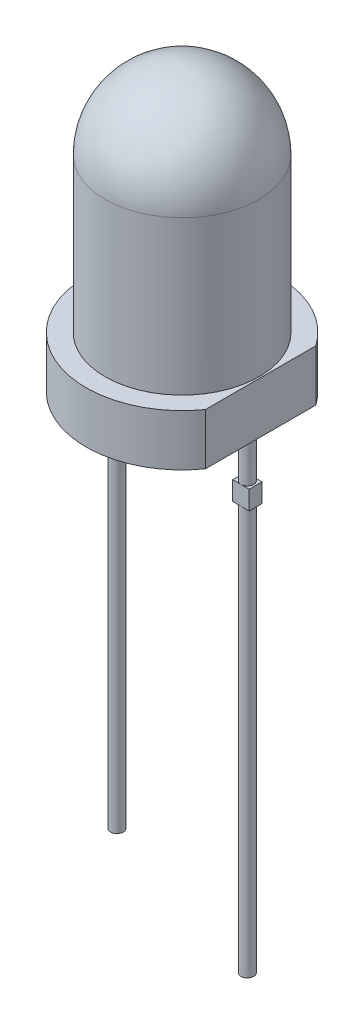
ISO-10303-21;
HEADER;
FILE_DESCRIPTION(('STEP AP214'),'2;1');
FILE_NAME('part.step','',(''),(''),'','','');
FILE_SCHEMA(('AUTOMOTIVE_DESIGN { 1 0 10303 214 1 1 1 1 }'));
ENDSEC;
DATA;
#1=APPLICATION_CONTEXT('core data for automotive mechanical design processes');
#2=APPLICATION_PROTOCOL_DEFINITION('international standard','automotive_design',2000,#1);
#3=PRODUCT_CONTEXT('',#1,'mechanical');
#4=PRODUCT('Part','Part','',(#3));
#5=PRODUCT_RELATED_PRODUCT_CATEGORY('part','',(#4));
#6=PRODUCT_DEFINITION_FORMATION('','',#4);
#7=PRODUCT_DEFINITION_CONTEXT('part definition',#1,'design');
#8=PRODUCT_DEFINITION('design','',#6,#7);
#9=PRODUCT_DEFINITION_SHAPE('','',#8);
#10=(LENGTH_UNIT() NAMED_UNIT(*) SI_UNIT(.MILLI.,.METRE.));
#11=(NAMED_UNIT(*) PLANE_ANGLE_UNIT() SI_UNIT($,.RADIAN.));
#12=(NAMED_UNIT(*) SI_UNIT($,.STERADIAN.) SOLID_ANGLE_UNIT());
#13=UNCERTAINTY_MEASURE_WITH_UNIT(LENGTH_MEASURE(1.E-05),#10,'distance_accuracy_value','');
#14=(GEOMETRIC_REPRESENTATION_CONTEXT(3) GLOBAL_UNCERTAINTY_ASSIGNED_CONTEXT((#13)) GLOBAL_UNIT_ASSIGNED_CONTEXT((#10,
#11,#12)) REPRESENTATION_CONTEXT('',''));
#15=CARTESIAN_POINT('',(0.,0.,0.));
#16=DIRECTION('',(0.,0.,1.));
#17=DIRECTION('',(1.,0.,0.));
#18=AXIS2_PLACEMENT_3D('',#15,#16,#17);
#19=CARTESIAN_POINT('',(1.11932207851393,2.68134159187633,3.73370281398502));
#20=DIRECTION('',(0.,-1.,0.));
#21=DIRECTION('',(0.,0.,-1.));
#22=AXIS2_PLACEMENT_3D('',#19,#20,#21);
#23=CYLINDRICAL_SURFACE('',#22,1.87);
#24=CARTESIAN_POINT('',(1.11932207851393,2.68134159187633,3.73370281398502));
#25=DIRECTION('',(0.,1.,0.));
#26=DIRECTION('',(0.,0.,1.));
#27=AXIS2_PLACEMENT_3D('',#24,#25,#26);
#28=CIRCLE('',#27,1.87);
#29=CARTESIAN_POINT('',(2.64934061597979,2.68134159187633,2.65855478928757));
#30=VERTEX_POINT('',#29);
#31=CARTESIAN_POINT('',(2.64934061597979,2.68134159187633,4.80885083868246));
#32=VERTEX_POINT('',#31);
#33=EDGE_CURVE('P0_E52',#30,#32,#28,.T.);
#34=ORIENTED_EDGE('',*,*,#33,.F.);
#35=DIRECTION('',(0.,-1.,0.));
#36=VECTOR('',#35,1.);
#37=CARTESIAN_POINT('',(2.64934061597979,2.68134159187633,2.65855478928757));
#38=LINE('',#37,#36);
#39=CARTESIAN_POINT('',(2.64934061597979,1.68134159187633,2.65855478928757));
#40=VERTEX_POINT('',#39);
#41=EDGE_CURVE('P0_E38',#30,#40,#38,.T.);
#42=ORIENTED_EDGE('',*,*,#41,.T.);
#43=CARTESIAN_POINT('',(1.11932207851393,1.68134159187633,3.73370281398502));
#44=DIRECTION('',(0.,1.,0.));
#45=DIRECTION('',(0.,0.,1.));
#46=AXIS2_PLACEMENT_3D('',#43,#44,#45);
#47=CIRCLE('',#46,1.87);
#48=CARTESIAN_POINT('',(2.64934061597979,1.68134159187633,4.80885083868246));
#49=VERTEX_POINT('',#48);
#50=EDGE_CURVE('P0_E54',#40,#49,#47,.T.);
#51=ORIENTED_EDGE('',*,*,#50,.T.);
#52=DIRECTION('',(0.,-1.,0.));
#53=VECTOR('',#52,1.);
#54=CARTESIAN_POINT('',(2.64934061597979,2.68134159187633,4.80885083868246));
#55=LINE('',#54,#53);
#56=EDGE_CURVE('P0_E31',#49,#32,#55,.F.);
#57=ORIENTED_EDGE('',*,*,#56,.T.);
#58=EDGE_LOOP('',(#34,#42,#51,#57));
#59=FACE_BOUND('',#58,.T.);
#60=ADVANCED_FACE('P0_F17',(#59),#23,.T.);
#61=CARTESIAN_POINT('',(1.11932207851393,2.68134159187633,3.73370281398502));
#62=DIRECTION('',(0.,1.,0.));
#63=DIRECTION('',(0.,0.,1.));
#64=AXIS2_PLACEMENT_3D('',#61,#62,#63);
#65=PLANE('',#64);
#66=DIRECTION('',(0.,0.,1.));
#67=VECTOR('',#66,1.);
#68=CARTESIAN_POINT('',(2.64934061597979,2.68134159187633,2.22652795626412));
#69=LINE('',#68,#67);
#70=EDGE_CURVE('P0_E41',#30,#32,#69,.T.);
#71=ORIENTED_EDGE('',*,*,#70,.F.);
#72=ORIENTED_EDGE('',*,*,#33,.T.);
#73=EDGE_LOOP('',(#71,#72));
#74=FACE_BOUND('',#73,.T.);
#75=CARTESIAN_POINT('',(1.11932207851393,2.68134159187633,3.73370281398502));
#76=DIRECTION('',(0.,1.,0.));
#77=DIRECTION('',(0.,0.,1.));
#78=AXIS2_PLACEMENT_3D('',#75,#76,#77);
#79=CIRCLE('',#78,1.5);
#80=CARTESIAN_POINT('',(1.11932207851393,2.68134159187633,5.23370281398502));
#81=VERTEX_POINT('',#80);
#82=EDGE_CURVE('P0_E24',#81,#81,#79,.T.);
#83=ORIENTED_EDGE('',*,*,#82,.F.);
#84=EDGE_LOOP('',(#83));
#85=FACE_BOUND('',#84,.T.);
#86=ADVANCED_FACE('P0_F50',(#74,#85),#65,.T.);
#87=CARTESIAN_POINT('',(1.11932207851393,1.68134159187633,3.73370281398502));
#88=DIRECTION('',(0.,1.,0.));
#89=DIRECTION('',(0.,0.,1.));
#90=AXIS2_PLACEMENT_3D('',#87,#88,#89);
#91=PLANE('',#90);
#92=ORIENTED_EDGE('',*,*,#50,.F.);
#93=DIRECTION('',(0.,0.,1.));
#94=VECTOR('',#93,1.);
#95=CARTESIAN_POINT('',(2.64934061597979,1.68134159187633,3.73370281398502));
#96=LINE('',#95,#94);
#97=EDGE_CURVE('P0_E11',#40,#49,#96,.T.);
#98=ORIENTED_EDGE('',*,*,#97,.T.);
#99=EDGE_LOOP('',(#92,#98));
#100=FACE_BOUND('',#99,.T.);
#101=ADVANCED_FACE('P0_F67',(#100),#91,.F.);
#102=CARTESIAN_POINT('',(1.11932207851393,7.17134159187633,3.73370281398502));
#103=DIRECTION('',(0.,1.,0.));
#104=DIRECTION('',(-1.,0.,0.));
#105=AXIS2_PLACEMENT_3D('',#102,#103,#104);
#106=CYLINDRICAL_SURFACE('',#105,1.5);
#107=ORIENTED_EDGE('',*,*,#82,.T.);
#108=EDGE_LOOP('',(#107));
#109=FACE_BOUND('',#108,.T.);
#110=CARTESIAN_POINT('',(1.11932207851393,5.67134159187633,3.73370281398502));
#111=DIRECTION('',(0.,1.,0.));
#112=DIRECTION('',(-1.,0.,0.));
#113=AXIS2_PLACEMENT_3D('',#110,#111,#112);
#114=CIRCLE('',#113,1.5);
#115=CARTESIAN_POINT('',(-0.380677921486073,5.67134159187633,3.73370281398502));
#116=VERTEX_POINT('',#115);
#117=EDGE_CURVE('P0_E46',#116,#116,#114,.T.);
#118=ORIENTED_EDGE('',*,*,#117,.F.);
#119=EDGE_LOOP('',(#118));
#120=FACE_BOUND('',#119,.T.);
#121=ADVANCED_FACE('P0_F65',(#109,#120),#106,.T.);
#122=CARTESIAN_POINT('',(1.11932207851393,5.67134159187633,3.73370281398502));
#123=DIRECTION('',(0.,1.,0.));
#124=DIRECTION('',(1.,0.,0.));
#125=AXIS2_PLACEMENT_3D('',#122,#123,#124);
#126=SPHERICAL_SURFACE('',#125,1.5);
#127=ORIENTED_EDGE('',*,*,#117,.T.);
#128=EDGE_LOOP('',(#127));
#129=FACE_BOUND('',#128,.T.);
#130=ADVANCED_FACE('P0_F63',(#129),#126,.T.);
#131=CARTESIAN_POINT('',(2.64934061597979,1.68134159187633,2.22652795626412));
#132=DIRECTION('',(-1.,0.,0.));
#133=DIRECTION('',(0.,0.,1.));
#134=AXIS2_PLACEMENT_3D('',#131,#132,#133);
#135=PLANE('',#134);
#136=ORIENTED_EDGE('',*,*,#70,.T.);
#137=ORIENTED_EDGE('',*,*,#56,.F.);
#138=ORIENTED_EDGE('',*,*,#97,.F.);
#139=ORIENTED_EDGE('',*,*,#41,.F.);
#140=EDGE_LOOP('',(#136,#137,#138,#139));
#141=FACE_BOUND('',#140,.T.);
#142=ADVANCED_FACE('P0_F40',(#141),#135,.F.);
#143=CLOSED_SHELL('',(#60,#86,#101,#121,#130,#142));
#144=MANIFOLD_SOLID_BREP('P0_B1',#143);
#145=CARTESIAN_POINT('',(1.02895107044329,4.56451069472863,3.66701575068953));
#146=DIRECTION('',(0.,0.,-1.));
#147=DIRECTION('',(-1.,0.,0.));
#148=AXIS2_PLACEMENT_3D('',#145,#146,#147);
#149=PLANE('',#148);
#150=DIRECTION('',(-1.,0.,0.));
#151=VECTOR('',#150,1.);
#152=CARTESIAN_POINT('',(1.02895107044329,4.68927738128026,3.66701575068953));
#153=LINE('',#152,#151);
#154=CARTESIAN_POINT('',(1.20969308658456,4.68927738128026,3.66701575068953));
#155=VERTEX_POINT('',#154);
#156=CARTESIAN_POINT('',(1.02895107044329,4.68927738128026,3.66701575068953));
#157=VERTEX_POINT('',#156);
#158=EDGE_CURVE('P1_E81',#155,#157,#153,.T.);
#159=ORIENTED_EDGE('',*,*,#158,.F.);
#160=DIRECTION('',(0.,1.,0.));
#161=VECTOR('',#160,1.);
#162=CARTESIAN_POINT('',(1.20969308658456,4.56451069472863,3.66701575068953));
#163=LINE('',#162,#161);
#164=CARTESIAN_POINT('',(1.20969308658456,4.56451069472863,3.66701575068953));
#165=VERTEX_POINT('',#164);
#166=EDGE_CURVE('P1_E11',#165,#155,#163,.T.);
#167=ORIENTED_EDGE('',*,*,#166,.F.);
#168=DIRECTION('',(-1.,0.,0.));
#169=VECTOR('',#168,1.);
#170=CARTESIAN_POINT('',(1.02895107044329,4.56451069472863,3.66701575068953));
#171=LINE('',#170,#169);
#172=CARTESIAN_POINT('',(1.02895107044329,4.56451069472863,3.66701575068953));
#173=VERTEX_POINT('',#172);
#174=EDGE_CURVE('P1_E75',#165,#173,#171,.T.);
#175=ORIENTED_EDGE('',*,*,#174,.T.);
#176=DIRECTION('',(0.,1.,0.));
#177=VECTOR('',#176,1.);
#178=CARTESIAN_POINT('',(1.02895107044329,4.56451069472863,3.66701575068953));
#179=LINE('',#178,#177);
#180=EDGE_CURVE('P1_E20',#173,#157,#179,.T.);
#181=ORIENTED_EDGE('',*,*,#180,.T.);
#182=EDGE_LOOP('',(#159,#167,#175,#181));
#183=FACE_BOUND('',#182,.T.);
#184=ADVANCED_FACE('P1_F17',(#183),#149,.T.);
#185=CARTESIAN_POINT('',(1.20969308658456,4.56451069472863,3.80038987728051));
#186=DIRECTION('',(1.,0.,0.));
#187=DIRECTION('',(0.,0.,-1.));
#188=AXIS2_PLACEMENT_3D('',#185,#186,#187);
#189=PLANE('',#188);
#190=DIRECTION('',(0.,0.,-1.));
#191=VECTOR('',#190,1.);
#192=CARTESIAN_POINT('',(1.20969308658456,4.68927738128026,3.80038987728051));
#193=LINE('',#192,#191);
#194=CARTESIAN_POINT('',(1.20969308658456,4.68927738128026,3.80038987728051));
#195=VERTEX_POINT('',#194);
#196=EDGE_CURVE('P1_E77',#195,#155,#193,.T.);
#197=ORIENTED_EDGE('',*,*,#196,.F.);
#198=DIRECTION('',(0.,1.,0.));
#199=VECTOR('',#198,1.);
#200=CARTESIAN_POINT('',(1.20969308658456,4.56451069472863,3.80038987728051));
#201=LINE('',#200,#199);
#202=CARTESIAN_POINT('',(1.20969308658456,4.56451069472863,3.80038987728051));
#203=VERTEX_POINT('',#202);
#204=EDGE_CURVE('P1_E26',#203,#195,#201,.T.);
#205=ORIENTED_EDGE('',*,*,#204,.F.);
#206=DIRECTION('',(0.,0.,-1.));
#207=VECTOR('',#206,1.);
#208=CARTESIAN_POINT('',(1.20969308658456,4.56451069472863,3.80038987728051));
#209=LINE('',#208,#207);
#210=EDGE_CURVE('P1_E72',#203,#165,#209,.T.);
#211=ORIENTED_EDGE('',*,*,#210,.T.);
#212=ORIENTED_EDGE('',*,*,#166,.T.);
#213=EDGE_LOOP('',(#197,#205,#211,#212));
#214=FACE_BOUND('',#213,.T.);
#215=ADVANCED_FACE('P1_F91',(#214),#189,.T.);
#216=CARTESIAN_POINT('',(1.02895107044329,4.56451069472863,3.80038987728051));
#217=DIRECTION('',(0.,0.,1.));
#218=DIRECTION('',(1.,0.,0.));
#219=AXIS2_PLACEMENT_3D('',#216,#217,#218);
#220=PLANE('',#219);
#221=DIRECTION('',(1.,0.,0.));
#222=VECTOR('',#221,1.);
#223=CARTESIAN_POINT('',(1.02895107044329,4.68927738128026,3.80038987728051));
#224=LINE('',#223,#222);
#225=CARTESIAN_POINT('',(1.02895107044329,4.68927738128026,3.80038987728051));
#226=VERTEX_POINT('',#225);
#227=EDGE_CURVE('P1_E67',#226,#195,#224,.T.);
#228=ORIENTED_EDGE('',*,*,#227,.F.);
#229=DIRECTION('',(0.,1.,0.));
#230=VECTOR('',#229,1.);
#231=CARTESIAN_POINT('',(1.02895107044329,4.56451069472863,3.80038987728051));
#232=LINE('',#231,#230);
#233=CARTESIAN_POINT('',(1.02895107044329,4.56451069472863,3.80038987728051));
#234=VERTEX_POINT('',#233);
#235=EDGE_CURVE('P1_E62',#234,#226,#232,.T.);
#236=ORIENTED_EDGE('',*,*,#235,.F.);
#237=DIRECTION('',(1.,0.,0.));
#238=VECTOR('',#237,1.);
#239=CARTESIAN_POINT('',(1.02895107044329,4.56451069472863,3.80038987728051));
#240=LINE('',#239,#238);
#241=EDGE_CURVE('P1_E65',#234,#203,#240,.T.);
#242=ORIENTED_EDGE('',*,*,#241,.T.);
#243=ORIENTED_EDGE('',*,*,#204,.T.);
#244=EDGE_LOOP('',(#228,#236,#242,#243));
#245=FACE_BOUND('',#244,.T.);
#246=ADVANCED_FACE('P1_F64',(#245),#220,.T.);
#247=CARTESIAN_POINT('',(1.02895107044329,4.56451069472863,3.80038987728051));
#248=DIRECTION('',(-1.,0.,0.));
#249=DIRECTION('',(0.,0.,1.));
#250=AXIS2_PLACEMENT_3D('',#247,#248,#249);
#251=PLANE('',#250);
#252=DIRECTION('',(0.,0.,1.));
#253=VECTOR('',#252,1.);
#254=CARTESIAN_POINT('',(1.02895107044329,4.68927738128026,3.80038987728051));
#255=LINE('',#254,#253);
#256=EDGE_CURVE('P1_E84',#157,#226,#255,.T.);
#257=ORIENTED_EDGE('',*,*,#256,.F.);
#258=ORIENTED_EDGE('',*,*,#180,.F.);
#259=DIRECTION('',(0.,0.,1.));
#260=VECTOR('',#259,1.);
#261=CARTESIAN_POINT('',(1.02895107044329,4.56451069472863,3.80038987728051));
#262=LINE('',#261,#260);
#263=EDGE_CURVE('P1_E71',#173,#234,#262,.T.);
#264=ORIENTED_EDGE('',*,*,#263,.T.);
#265=ORIENTED_EDGE('',*,*,#235,.T.);
#266=EDGE_LOOP('',(#257,#258,#264,#265));
#267=FACE_BOUND('',#266,.T.);
#268=ADVANCED_FACE('P1_F74',(#267),#251,.T.);
#269=CARTESIAN_POINT('',(1.11932207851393,4.56451069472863,3.73370281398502));
#270=DIRECTION('',(0.,1.,0.));
#271=DIRECTION('',(-1.,0.,0.));
#272=AXIS2_PLACEMENT_3D('',#269,#270,#271);
#273=PLANE('',#272);
#274=ORIENTED_EDGE('',*,*,#174,.F.);
#275=ORIENTED_EDGE('',*,*,#210,.F.);
#276=ORIENTED_EDGE('',*,*,#241,.F.);
#277=ORIENTED_EDGE('',*,*,#263,.F.);
#278=EDGE_LOOP('',(#274,#275,#276,#277));
#279=FACE_BOUND('',#278,.T.);
#280=ADVANCED_FACE('P1_F70',(#279),#273,.F.);
#281=CARTESIAN_POINT('',(1.11932207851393,4.68927738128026,3.73370281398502));
#282=DIRECTION('',(0.,1.,0.));
#283=DIRECTION('',(-1.,0.,0.));
#284=AXIS2_PLACEMENT_3D('',#281,#282,#283);
#285=PLANE('',#284);
#286=ORIENTED_EDGE('',*,*,#158,.T.);
#287=ORIENTED_EDGE('',*,*,#256,.T.);
#288=ORIENTED_EDGE('',*,*,#227,.T.);
#289=ORIENTED_EDGE('',*,*,#196,.T.);
#290=EDGE_LOOP('',(#286,#287,#288,#289));
#291=FACE_BOUND('',#290,.T.);
#292=ADVANCED_FACE('P1_F90',(#291),#285,.T.);
#293=CLOSED_SHELL('',(#184,#215,#246,#268,#280,#292));
#294=MANIFOLD_SOLID_BREP('P1_B1',#293);
#295=CARTESIAN_POINT('',(2.38932207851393,2.68134159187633,3.73370281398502));
#296=DIRECTION('',(0.,1.,0.));
#297=DIRECTION('',(-1.,0.,0.));
#298=AXIS2_PLACEMENT_3D('',#295,#296,#297);
#299=PLANE('',#298);
#300=CARTESIAN_POINT('',(2.38932207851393,2.68134159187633,3.73370281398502));
#301=DIRECTION('',(0.,1.,0.));
#302=DIRECTION('',(-1.,0.,0.));
#303=AXIS2_PLACEMENT_3D('',#300,#301,#302);
#304=CIRCLE('',#303,0.125);
#305=CARTESIAN_POINT('',(2.45714537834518,2.68134159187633,3.62870281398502));
#306=VERTEX_POINT('',#305);
#307=CARTESIAN_POINT('',(2.32149877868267,2.68134159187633,3.62870281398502));
#308=VERTEX_POINT('',#307);
#309=EDGE_CURVE('P2_E349',#306,#308,#304,.T.);
#310=ORIENTED_EDGE('',*,*,#309,.T.);
#311=DIRECTION('',(1.,0.,0.));
#312=VECTOR('',#311,1.);
#313=CARTESIAN_POINT('',(2.26432207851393,2.68134159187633,3.62870281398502));
#314=LINE('',#313,#312);
#315=EDGE_CURVE('P2_E243',#308,#306,#314,.T.);
#316=ORIENTED_EDGE('',*,*,#315,.T.);
#317=EDGE_LOOP('',(#310,#316));
#318=FACE_BOUND('',#317,.T.);
#319=ADVANCED_FACE('P2_F17',(#318),#299,.T.);
#320=CARTESIAN_POINT('',(2.38932207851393,-7.48300085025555,3.73370281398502));
#321=DIRECTION('',(0.,1.,0.));
#322=DIRECTION('',(-1.,0.,0.));
#323=AXIS2_PLACEMENT_3D('',#320,#321,#322);
#324=CYLINDRICAL_SURFACE('',#323,0.125);
#325=CARTESIAN_POINT('',(2.38932207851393,0.813451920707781,3.73370281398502));
#326=DIRECTION('',(0.,1.,0.));
#327=DIRECTION('',(-1.,0.,0.));
#328=AXIS2_PLACEMENT_3D('',#325,#326,#327);
#329=CIRCLE('',#328,0.125);
#330=CARTESIAN_POINT('',(2.38932207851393,0.813451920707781,3.60870281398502));
#331=VERTEX_POINT('',#330);
#332=CARTESIAN_POINT('',(2.38932207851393,0.813451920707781,3.85870281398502));
#333=VERTEX_POINT('',#332);
#334=EDGE_CURVE('P2_E11',#331,#333,#329,.F.);
#335=ORIENTED_EDGE('',*,*,#334,.F.);
#336=EDGE_CURVE('P2_E21',#333,#331,#329,.F.);
#337=ORIENTED_EDGE('',*,*,#336,.F.);
#338=EDGE_LOOP('',(#335,#337));
#339=FACE_BOUND('',#338,.T.);
#340=CARTESIAN_POINT('',(2.26432207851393,2.68134159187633,3.73370281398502));
#341=VERTEX_POINT('',#340);
#342=CARTESIAN_POINT('',(2.32149877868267,2.68134159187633,3.83870281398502));
#343=VERTEX_POINT('',#342);
#344=EDGE_CURVE('P2_E271',#341,#343,#304,.T.);
#345=ORIENTED_EDGE('',*,*,#344,.F.);
#346=EDGE_CURVE('P2_E254',#308,#341,#304,.T.);
#347=ORIENTED_EDGE('',*,*,#346,.F.);
#348=ORIENTED_EDGE('',*,*,#309,.F.);
#349=CARTESIAN_POINT('',(2.51432207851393,2.68134159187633,3.73370281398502));
#350=VERTEX_POINT('',#349);
#351=EDGE_CURVE('P2_E345',#350,#306,#304,.T.);
#352=ORIENTED_EDGE('',*,*,#351,.F.);
#353=CARTESIAN_POINT('',(2.45714537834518,2.68134159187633,3.83870281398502));
#354=VERTEX_POINT('',#353);
#355=EDGE_CURVE('P2_E344',#354,#350,#304,.T.);
#356=ORIENTED_EDGE('',*,*,#355,.F.);
#357=EDGE_CURVE('P2_E273',#343,#354,#304,.T.);
#358=ORIENTED_EDGE('',*,*,#357,.F.);
#359=EDGE_LOOP('',(#345,#347,#348,#352,#356,#358));
#360=FACE_BOUND('',#359,.T.);
#361=ADVANCED_FACE('P2_F19',(#339,#360),#324,.T.);
#362=DIRECTION('',(1.,0.,0.));
#363=VECTOR('',#362,1.);
#364=CARTESIAN_POINT('',(2.26432207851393,2.68134159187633,3.83870281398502));
#365=LINE('',#364,#363);
#366=EDGE_CURVE('P2_E224',#343,#354,#365,.T.);
#367=ORIENTED_EDGE('',*,*,#366,.F.);
#368=ORIENTED_EDGE('',*,*,#357,.T.);
#369=EDGE_LOOP('',(#367,#368));
#370=FACE_BOUND('',#369,.T.);
#371=ADVANCED_FACE('P2_F319',(#370),#299,.T.);
#372=CARTESIAN_POINT('',(2.26432207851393,2.68134159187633,3.62870281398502));
#373=DIRECTION('',(0.,-1.,0.));
#374=DIRECTION('',(1.,0.,0.));
#375=AXIS2_PLACEMENT_3D('',#372,#373,#374);
#376=PLANE('',#375);
#377=CARTESIAN_POINT('',(2.51432207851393,2.68134159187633,3.83870281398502));
#378=VERTEX_POINT('',#377);
#379=EDGE_CURVE('P2_E219',#354,#378,#365,.T.);
#380=ORIENTED_EDGE('',*,*,#379,.F.);
#381=ORIENTED_EDGE('',*,*,#355,.T.);
#382=DIRECTION('',(0.,0.,1.));
#383=VECTOR('',#382,1.);
#384=CARTESIAN_POINT('',(2.51432207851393,2.68134159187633,3.62870281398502));
#385=LINE('',#384,#383);
#386=EDGE_CURVE('P2_E260',#350,#378,#385,.T.);
#387=ORIENTED_EDGE('',*,*,#386,.T.);
#388=EDGE_LOOP('',(#380,#381,#387));
#389=FACE_BOUND('',#388,.T.);
#390=ADVANCED_FACE('P2_F325',(#389),#376,.T.);
#391=CARTESIAN_POINT('',(2.51432207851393,2.68134159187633,3.62870281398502));
#392=VERTEX_POINT('',#391);
#393=EDGE_CURVE('P2_E257',#392,#350,#385,.T.);
#394=ORIENTED_EDGE('',*,*,#393,.T.);
#395=ORIENTED_EDGE('',*,*,#351,.T.);
#396=EDGE_CURVE('P2_E238',#306,#392,#314,.T.);
#397=ORIENTED_EDGE('',*,*,#396,.T.);
#398=EDGE_LOOP('',(#394,#395,#397));
#399=FACE_BOUND('',#398,.T.);
#400=ADVANCED_FACE('P2_F330',(#399),#376,.T.);
#401=DIRECTION('',(0.,0.,1.));
#402=VECTOR('',#401,1.);
#403=CARTESIAN_POINT('',(2.26432207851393,2.68134159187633,3.62870281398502));
#404=LINE('',#403,#402);
#405=CARTESIAN_POINT('',(2.26432207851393,2.68134159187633,3.83870281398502));
#406=VERTEX_POINT('',#405);
#407=EDGE_CURVE('P2_E264',#341,#406,#404,.T.);
#408=ORIENTED_EDGE('',*,*,#407,.F.);
#409=ORIENTED_EDGE('',*,*,#344,.T.);
#410=EDGE_CURVE('P2_E220',#406,#343,#365,.T.);
#411=ORIENTED_EDGE('',*,*,#410,.F.);
#412=EDGE_LOOP('',(#408,#409,#411));
#413=FACE_BOUND('',#412,.T.);
#414=ADVANCED_FACE('P2_F359',(#413),#376,.T.);
#415=CARTESIAN_POINT('',(0.219936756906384,4.68927738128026,3.62870281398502));
#416=DIRECTION('',(-0.707106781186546,-0.707106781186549,0.));
#417=DIRECTION('',(0.707106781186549,-0.707106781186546,0.));
#418=AXIS2_PLACEMENT_3D('',#415,#416,#417);
#419=PLANE('',#418);
#420=DIRECTION('',(0.,0.,1.));
#421=VECTOR('',#420,1.);
#422=CARTESIAN_POINT('',(1.5619246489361,3.34728948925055,3.62870281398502));
#423=LINE('',#422,#421);
#424=CARTESIAN_POINT('',(1.5619246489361,3.34728948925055,3.62870281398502));
#425=VERTEX_POINT('',#424);
#426=CARTESIAN_POINT('',(1.5619246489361,3.34728948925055,3.83870281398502));
#427=VERTEX_POINT('',#426);
#428=EDGE_CURVE('P2_E250',#425,#427,#423,.T.);
#429=ORIENTED_EDGE('',*,*,#428,.T.);
#430=DIRECTION('',(0.707106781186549,-0.707106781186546,0.));
#431=VECTOR('',#430,1.);
#432=CARTESIAN_POINT('',(0.219936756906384,4.68927738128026,3.83870281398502));
#433=LINE('',#432,#431);
#434=CARTESIAN_POINT('',(0.219936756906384,4.68927738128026,3.83870281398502));
#435=VERTEX_POINT('',#434);
#436=EDGE_CURVE('P2_E210',#435,#427,#433,.T.);
#437=ORIENTED_EDGE('',*,*,#436,.F.);
#438=DIRECTION('',(0.,0.,1.));
#439=VECTOR('',#438,1.);
#440=CARTESIAN_POINT('',(0.219936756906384,4.68927738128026,3.62870281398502));
#441=LINE('',#440,#439);
#442=CARTESIAN_POINT('',(0.219936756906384,4.68927738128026,3.62870281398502));
#443=VERTEX_POINT('',#442);
#444=EDGE_CURVE('P2_E251',#443,#435,#441,.T.);
#445=ORIENTED_EDGE('',*,*,#444,.F.);
#446=DIRECTION('',(0.707106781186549,-0.707106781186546,0.));
#447=VECTOR('',#446,1.);
#448=CARTESIAN_POINT('',(0.219936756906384,4.68927738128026,3.62870281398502));
#449=LINE('',#448,#447);
#450=EDGE_CURVE('P2_E230',#443,#425,#449,.T.);
#451=ORIENTED_EDGE('',*,*,#450,.T.);
#452=EDGE_LOOP('',(#429,#437,#445,#451));
#453=FACE_BOUND('',#452,.T.);
#454=ADVANCED_FACE('P2_F414',(#453),#419,.T.);
#455=CARTESIAN_POINT('',(0.219936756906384,4.68927738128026,3.62870281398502));
#456=DIRECTION('',(0.,-1.,0.));
#457=DIRECTION('',(1.,0.,0.));
#458=AXIS2_PLACEMENT_3D('',#455,#456,#457);
#459=PLANE('',#458);
#460=CARTESIAN_POINT('',(1.11932207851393,4.68927738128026,3.727965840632));
#461=DIRECTION('',(0.,-1.,0.));
#462=DIRECTION('',(1.,0.,0.));
#463=AXIS2_PLACEMENT_3D('',#460,#461,#462);
#464=CIRCLE('',#463,0.184574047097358);
#465=CARTESIAN_POINT('',(1.30389612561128,4.68927738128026,3.727965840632));
#466=VERTEX_POINT('',#465);
#467=EDGE_CURVE('P2_E165',#466,#466,#464,.F.);
#468=ORIENTED_EDGE('',*,*,#467,.F.);
#469=EDGE_LOOP('',(#468));
#470=FACE_BOUND('',#469,.T.);
#471=DIRECTION('',(-1.,0.,0.));
#472=VECTOR('',#471,1.);
#473=CARTESIAN_POINT('',(2.51432207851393,4.68927738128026,3.62870281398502));
#474=LINE('',#473,#472);
#475=CARTESIAN_POINT('',(2.51432207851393,4.68927738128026,3.62870281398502));
#476=VERTEX_POINT('',#475);
#477=CARTESIAN_POINT('',(1.30838474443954,4.68927738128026,3.62870281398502));
#478=VERTEX_POINT('',#477);
#479=EDGE_CURVE('P2_E247',#476,#478,#474,.T.);
#480=ORIENTED_EDGE('',*,*,#479,.T.);
#481=CARTESIAN_POINT('',(1.11932207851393,4.68927738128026,3.73370281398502));
#482=DIRECTION('',(0.,1.,0.));
#483=DIRECTION('',(-1.,0.,0.));
#484=AXIS2_PLACEMENT_3D('',#481,#482,#483);
#485=CIRCLE('',#484,0.216263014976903);
#486=CARTESIAN_POINT('',(0.930259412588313,4.68927738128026,3.62870281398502));
#487=VERTEX_POINT('',#486);
#488=EDGE_CURVE('P2_E202',#478,#487,#485,.T.);
#489=ORIENTED_EDGE('',*,*,#488,.T.);
#490=EDGE_CURVE('P2_E246',#487,#443,#474,.T.);
#491=ORIENTED_EDGE('',*,*,#490,.T.);
#492=ORIENTED_EDGE('',*,*,#444,.T.);
#493=DIRECTION('',(-1.,0.,0.));
#494=VECTOR('',#493,1.);
#495=CARTESIAN_POINT('',(2.51432207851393,4.68927738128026,3.83870281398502));
#496=LINE('',#495,#494);
#497=CARTESIAN_POINT('',(0.930259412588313,4.68927738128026,3.83870281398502));
#498=VERTEX_POINT('',#497);
#499=EDGE_CURVE('P2_E227',#498,#435,#496,.T.);
#500=ORIENTED_EDGE('',*,*,#499,.F.);
#501=CARTESIAN_POINT('',(1.30838474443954,4.68927738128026,3.83870281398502));
#502=VERTEX_POINT('',#501);
#503=EDGE_CURVE('P2_E199',#498,#502,#485,.T.);
#504=ORIENTED_EDGE('',*,*,#503,.T.);
#505=CARTESIAN_POINT('',(2.51432207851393,4.68927738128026,3.83870281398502));
#506=VERTEX_POINT('',#505);
#507=EDGE_CURVE('P2_E228',#506,#502,#496,.T.);
#508=ORIENTED_EDGE('',*,*,#507,.F.);
#509=DIRECTION('',(0.,0.,1.));
#510=VECTOR('',#509,1.);
#511=CARTESIAN_POINT('',(2.51432207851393,4.68927738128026,3.62870281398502));
#512=LINE('',#511,#510);
#513=EDGE_CURVE('P2_E255',#476,#506,#512,.T.);
#514=ORIENTED_EDGE('',*,*,#513,.F.);
#515=EDGE_LOOP('',(#480,#489,#491,#492,#500,#504,#508,#514));
#516=FACE_BOUND('',#515,.T.);
#517=ADVANCED_FACE('P2_F375',(#470,#516),#459,.F.);
#518=CARTESIAN_POINT('',(2.51432207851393,2.68134159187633,3.62870281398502));
#519=DIRECTION('',(1.,0.,0.));
#520=DIRECTION('',(0.,0.,-1.));
#521=AXIS2_PLACEMENT_3D('',#518,#519,#520);
#522=PLANE('',#521);
#523=ORIENTED_EDGE('',*,*,#513,.T.);
#524=DIRECTION('',(0.,1.,0.));
#525=VECTOR('',#524,1.);
#526=CARTESIAN_POINT('',(2.51432207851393,2.68134159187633,3.83870281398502));
#527=LINE('',#526,#525);
#528=EDGE_CURVE('P2_E223',#378,#506,#527,.T.);
#529=ORIENTED_EDGE('',*,*,#528,.F.);
#530=ORIENTED_EDGE('',*,*,#386,.F.);
#531=ORIENTED_EDGE('',*,*,#393,.F.);
#532=DIRECTION('',(0.,1.,0.));
#533=VECTOR('',#532,1.);
#534=CARTESIAN_POINT('',(2.51432207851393,2.68134159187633,3.62870281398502));
#535=LINE('',#534,#533);
#536=EDGE_CURVE('P2_E242',#392,#476,#535,.T.);
#537=ORIENTED_EDGE('',*,*,#536,.T.);
#538=EDGE_LOOP('',(#523,#529,#530,#531,#537));
#539=FACE_BOUND('',#538,.T.);
#540=ADVANCED_FACE('P2_F371',(#539),#522,.T.);
#541=CARTESIAN_POINT('',(2.26432207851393,2.68134159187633,3.62870281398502));
#542=VERTEX_POINT('',#541);
#543=EDGE_CURVE('P2_E239',#542,#308,#314,.T.);
#544=ORIENTED_EDGE('',*,*,#543,.T.);
#545=ORIENTED_EDGE('',*,*,#346,.T.);
#546=EDGE_CURVE('P2_E261',#542,#341,#404,.T.);
#547=ORIENTED_EDGE('',*,*,#546,.F.);
#548=EDGE_LOOP('',(#544,#545,#547));
#549=FACE_BOUND('',#548,.T.);
#550=ADVANCED_FACE('P2_F333',(#549),#376,.T.);
#551=CARTESIAN_POINT('',(2.26432207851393,2.68134159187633,3.62870281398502));
#552=DIRECTION('',(1.,0.,0.));
#553=DIRECTION('',(0.,0.,-1.));
#554=AXIS2_PLACEMENT_3D('',#551,#552,#553);
#555=PLANE('',#554);
#556=ORIENTED_EDGE('',*,*,#546,.T.);
#557=ORIENTED_EDGE('',*,*,#407,.T.);
#558=DIRECTION('',(0.,1.,0.));
#559=VECTOR('',#558,1.);
#560=CARTESIAN_POINT('',(2.26432207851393,2.68134159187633,3.83870281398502));
#561=LINE('',#560,#559);
#562=CARTESIAN_POINT('',(2.26432207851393,3.34728948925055,3.83870281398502));
#563=VERTEX_POINT('',#562);
#564=EDGE_CURVE('P2_E216',#406,#563,#561,.T.);
#565=ORIENTED_EDGE('',*,*,#564,.T.);
#566=DIRECTION('',(0.,0.,1.));
#567=VECTOR('',#566,1.);
#568=CARTESIAN_POINT('',(2.26432207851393,3.34728948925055,3.62870281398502));
#569=LINE('',#568,#567);
#570=CARTESIAN_POINT('',(2.26432207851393,3.34728948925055,3.62870281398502));
#571=VERTEX_POINT('',#570);
#572=EDGE_CURVE('P2_E265',#571,#563,#569,.T.);
#573=ORIENTED_EDGE('',*,*,#572,.F.);
#574=DIRECTION('',(0.,1.,0.));
#575=VECTOR('',#574,1.);
#576=CARTESIAN_POINT('',(2.26432207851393,2.68134159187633,3.62870281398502));
#577=LINE('',#576,#575);
#578=EDGE_CURVE('P2_E236',#542,#571,#577,.T.);
#579=ORIENTED_EDGE('',*,*,#578,.F.);
#580=EDGE_LOOP('',(#556,#557,#565,#573,#579));
#581=FACE_BOUND('',#580,.T.);
#582=ADVANCED_FACE('P2_F362',(#581),#555,.F.);
#583=CARTESIAN_POINT('',(1.5619246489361,3.34728948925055,3.62870281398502));
#584=DIRECTION('',(0.,-1.,0.));
#585=DIRECTION('',(1.,0.,0.));
#586=AXIS2_PLACEMENT_3D('',#583,#584,#585);
#587=PLANE('',#586);
#588=ORIENTED_EDGE('',*,*,#572,.T.);
#589=DIRECTION('',(1.,0.,0.));
#590=VECTOR('',#589,1.);
#591=CARTESIAN_POINT('',(1.5619246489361,3.34728948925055,3.83870281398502));
#592=LINE('',#591,#590);
#593=EDGE_CURVE('P2_E213',#427,#563,#592,.T.);
#594=ORIENTED_EDGE('',*,*,#593,.F.);
#595=ORIENTED_EDGE('',*,*,#428,.F.);
#596=DIRECTION('',(1.,0.,0.));
#597=VECTOR('',#596,1.);
#598=CARTESIAN_POINT('',(1.5619246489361,3.34728948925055,3.62870281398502));
#599=LINE('',#598,#597);
#600=EDGE_CURVE('P2_E233',#425,#571,#599,.T.);
#601=ORIENTED_EDGE('',*,*,#600,.T.);
#602=EDGE_LOOP('',(#588,#594,#595,#601));
#603=FACE_BOUND('',#602,.T.);
#604=ADVANCED_FACE('P2_F417',(#603),#587,.T.);
#605=CARTESIAN_POINT('',(1.11932207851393,2.68134159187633,3.62870281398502));
#606=DIRECTION('',(0.,0.,1.));
#607=DIRECTION('',(1.,0.,0.));
#608=AXIS2_PLACEMENT_3D('',#605,#606,#607);
#609=PLANE('',#608);
#610=DIRECTION('',(-1.,0.,0.));
#611=VECTOR('',#610,1.);
#612=CARTESIAN_POINT('',(1.11932207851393,4.45636160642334,3.62870281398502));
#613=LINE('',#612,#611);
#614=CARTESIAN_POINT('',(1.30838474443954,4.45636160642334,3.62870281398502));
#615=VERTEX_POINT('',#614);
#616=CARTESIAN_POINT('',(0.930259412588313,4.45636160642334,3.62870281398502));
#617=VERTEX_POINT('',#616);
#618=EDGE_CURVE('P2_E197',#615,#617,#613,.T.);
#619=ORIENTED_EDGE('',*,*,#618,.F.);
#620=DIRECTION('',(0.,1.,0.));
#621=VECTOR('',#620,1.);
#622=CARTESIAN_POINT('',(1.30838474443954,4.45636160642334,3.62870281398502));
#623=LINE('',#622,#621);
#624=EDGE_CURVE('P2_E207',#615,#478,#623,.T.);
#625=ORIENTED_EDGE('',*,*,#624,.T.);
#626=ORIENTED_EDGE('',*,*,#479,.F.);
#627=ORIENTED_EDGE('',*,*,#536,.F.);
#628=ORIENTED_EDGE('',*,*,#396,.F.);
#629=ORIENTED_EDGE('',*,*,#315,.F.);
#630=ORIENTED_EDGE('',*,*,#543,.F.);
#631=ORIENTED_EDGE('',*,*,#578,.T.);
#632=ORIENTED_EDGE('',*,*,#600,.F.);
#633=ORIENTED_EDGE('',*,*,#450,.F.);
#634=ORIENTED_EDGE('',*,*,#490,.F.);
#635=DIRECTION('',(0.,1.,0.));
#636=VECTOR('',#635,1.);
#637=CARTESIAN_POINT('',(0.930259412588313,4.45636160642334,3.62870281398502));
#638=LINE('',#637,#636);
#639=EDGE_CURVE('P2_E204',#487,#617,#638,.F.);
#640=ORIENTED_EDGE('',*,*,#639,.T.);
#641=EDGE_LOOP('',(#619,#625,#626,#627,#628,#629,#630,#631,#632,#633,#634,#640));
#642=FACE_BOUND('',#641,.T.);
#643=ADVANCED_FACE('P2_F367',(#642),#609,.F.);
#644=CARTESIAN_POINT('',(1.11932207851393,2.68134159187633,3.83870281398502));
#645=DIRECTION('',(0.,0.,1.));
#646=DIRECTION('',(1.,0.,0.));
#647=AXIS2_PLACEMENT_3D('',#644,#645,#646);
#648=PLANE('',#647);
#649=DIRECTION('',(0.,1.,0.));
#650=VECTOR('',#649,1.);
#651=CARTESIAN_POINT('',(1.30838474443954,4.45636160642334,3.83870281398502));
#652=LINE('',#651,#650);
#653=CARTESIAN_POINT('',(1.30838474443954,4.45636160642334,3.83870281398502));
#654=VERTEX_POINT('',#653);
#655=EDGE_CURVE('P2_E279',#654,#502,#652,.T.);
#656=ORIENTED_EDGE('',*,*,#655,.F.);
#657=DIRECTION('',(-1.,0.,0.));
#658=VECTOR('',#657,1.);
#659=CARTESIAN_POINT('',(1.11932207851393,4.45636160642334,3.83870281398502));
#660=LINE('',#659,#658);
#661=CARTESIAN_POINT('',(0.930259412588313,4.45636160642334,3.83870281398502));
#662=VERTEX_POINT('',#661);
#663=EDGE_CURVE('P2_E274',#654,#662,#660,.T.);
#664=ORIENTED_EDGE('',*,*,#663,.T.);
#665=DIRECTION('',(0.,1.,0.));
#666=VECTOR('',#665,1.);
#667=CARTESIAN_POINT('',(0.930259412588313,4.45636160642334,3.83870281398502));
#668=LINE('',#667,#666);
#669=EDGE_CURVE('P2_E276',#498,#662,#668,.F.);
#670=ORIENTED_EDGE('',*,*,#669,.F.);
#671=ORIENTED_EDGE('',*,*,#499,.T.);
#672=ORIENTED_EDGE('',*,*,#436,.T.);
#673=ORIENTED_EDGE('',*,*,#593,.T.);
#674=ORIENTED_EDGE('',*,*,#564,.F.);
#675=ORIENTED_EDGE('',*,*,#410,.T.);
#676=ORIENTED_EDGE('',*,*,#366,.T.);
#677=ORIENTED_EDGE('',*,*,#379,.T.);
#678=ORIENTED_EDGE('',*,*,#528,.T.);
#679=ORIENTED_EDGE('',*,*,#507,.T.);
#680=EDGE_LOOP('',(#656,#664,#670,#671,#672,#673,#674,#675,#676,#677,#678,#679));
#681=FACE_BOUND('',#680,.T.);
#682=ADVANCED_FACE('P2_F378',(#681),#648,.T.);
#683=CARTESIAN_POINT('',(1.11932207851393,4.45636160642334,3.73370281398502));
#684=DIRECTION('',(0.,1.,0.));
#685=DIRECTION('',(-1.,0.,0.));
#686=AXIS2_PLACEMENT_3D('',#683,#684,#685);
#687=PLANE('',#686);
#688=ORIENTED_EDGE('',*,*,#663,.F.);
#689=CARTESIAN_POINT('',(1.11932207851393,4.45636160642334,3.73370281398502));
#690=DIRECTION('',(0.,1.,0.));
#691=DIRECTION('',(-1.,0.,0.));
#692=AXIS2_PLACEMENT_3D('',#689,#690,#691);
#693=CIRCLE('',#692,0.216263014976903);
#694=EDGE_CURVE('P2_E194',#662,#654,#693,.T.);
#695=ORIENTED_EDGE('',*,*,#694,.F.);
#696=EDGE_LOOP('',(#688,#695));
#697=FACE_BOUND('',#696,.T.);
#698=ADVANCED_FACE('P2_F388',(#697),#687,.F.);
#699=CARTESIAN_POINT('',(1.11932207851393,4.45636160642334,3.73370281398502));
#700=DIRECTION('',(0.,1.,0.));
#701=DIRECTION('',(-1.,0.,0.));
#702=AXIS2_PLACEMENT_3D('',#699,#700,#701);
#703=CYLINDRICAL_SURFACE('',#702,0.216263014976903);
#704=ORIENTED_EDGE('',*,*,#694,.T.);
#705=ORIENTED_EDGE('',*,*,#655,.T.);
#706=ORIENTED_EDGE('',*,*,#503,.F.);
#707=ORIENTED_EDGE('',*,*,#669,.T.);
#708=EDGE_LOOP('',(#704,#705,#706,#707));
#709=FACE_BOUND('',#708,.T.);
#710=ADVANCED_FACE('P2_F382',(#709),#703,.T.);
#711=ORIENTED_EDGE('',*,*,#624,.F.);
#712=EDGE_CURVE('P2_E198',#615,#617,#693,.T.);
#713=ORIENTED_EDGE('',*,*,#712,.T.);
#714=ORIENTED_EDGE('',*,*,#639,.F.);
#715=ORIENTED_EDGE('',*,*,#488,.F.);
#716=EDGE_LOOP('',(#711,#713,#714,#715));
#717=FACE_BOUND('',#716,.T.);
#718=ADVANCED_FACE('P2_F396',(#717),#703,.T.);
#719=ORIENTED_EDGE('',*,*,#712,.F.);
#720=ORIENTED_EDGE('',*,*,#618,.T.);
#721=EDGE_LOOP('',(#719,#720));
#722=FACE_BOUND('',#721,.T.);
#723=ADVANCED_FACE('P2_F391',(#722),#687,.F.);
#724=CARTESIAN_POINT('',(1.11932207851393,4.68927738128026,3.727965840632));
#725=DIRECTION('',(0.,0.,1.));
#726=DIRECTION('',(0.,-1.,0.));
#727=AXIS2_PLACEMENT_3D('',#724,#725,#726);
#728=SPHERICAL_SURFACE('',#727,0.184574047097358);
#729=CARTESIAN_POINT('',(1.11932207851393,4.68927738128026,3.727965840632));
#730=DIRECTION('',(0.,-1.,0.));
#731=DIRECTION('',(1.,0.,0.));
#732=AXIS2_PLACEMENT_3D('',#729,#730,#731);
#733=SPHERICAL_SURFACE('',#732,0.184574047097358);
#734=ORIENTED_EDGE('',*,*,#467,.T.);
#735=EDGE_LOOP('',(#734));
#736=FACE_BOUND('',#735,.T.);
#737=ADVANCED_FACE('P2_F401',(#736),#733,.F.);
#738=CARTESIAN_POINT('',(1.11932207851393,0.813451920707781,3.85870281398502));
#739=DIRECTION('',(0.,1.,0.));
#740=DIRECTION('',(-1.,0.,0.));
#741=AXIS2_PLACEMENT_3D('',#738,#739,#740);
#742=PLANE('',#741);
#743=DIRECTION('',(1.,0.,0.));
#744=VECTOR('',#743,1.);
#745=CARTESIAN_POINT('',(1.11932207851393,0.813451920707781,3.60870281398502));
#746=LINE('',#745,#744);
#747=CARTESIAN_POINT('',(2.55111705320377,0.813451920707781,3.60870281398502));
#748=VERTEX_POINT('',#747);
#749=EDGE_CURVE('P2_E147',#331,#748,#746,.T.);
#750=ORIENTED_EDGE('',*,*,#749,.F.);
#751=ORIENTED_EDGE('',*,*,#334,.T.);
#752=DIRECTION('',(1.,0.,0.));
#753=VECTOR('',#752,1.);
#754=CARTESIAN_POINT('',(1.11932207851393,0.813451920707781,3.85870281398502));
#755=LINE('',#754,#753);
#756=CARTESIAN_POINT('',(2.55111705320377,0.813451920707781,3.85870281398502));
#757=VERTEX_POINT('',#756);
#758=EDGE_CURVE('P2_E161',#333,#757,#755,.T.);
#759=ORIENTED_EDGE('',*,*,#758,.T.);
#760=DIRECTION('',(0.,0.,-1.));
#761=VECTOR('',#760,1.);
#762=CARTESIAN_POINT('',(2.55111705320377,0.813451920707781,3.85870281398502));
#763=LINE('',#762,#761);
#764=EDGE_CURVE('P2_E158',#757,#748,#763,.T.);
#765=ORIENTED_EDGE('',*,*,#764,.T.);
#766=EDGE_LOOP('',(#750,#751,#759,#765));
#767=FACE_BOUND('',#766,.T.);
#768=ADVANCED_FACE('P2_F159',(#767),#742,.T.);
#769=CARTESIAN_POINT('',(1.11932207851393,0.446511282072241,3.85870281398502));
#770=DIRECTION('',(0.,1.,0.));
#771=DIRECTION('',(-1.,0.,0.));
#772=AXIS2_PLACEMENT_3D('',#769,#770,#771);
#773=PLANE('',#772);
#774=CARTESIAN_POINT('',(2.38932207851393,0.446511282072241,3.73370281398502));
#775=DIRECTION('',(0.,1.,0.));
#776=DIRECTION('',(-1.,0.,0.));
#777=AXIS2_PLACEMENT_3D('',#774,#775,#776);
#778=CIRCLE('',#777,0.125);
#779=CARTESIAN_POINT('',(2.38932207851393,0.446511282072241,3.60870281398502));
#780=VERTEX_POINT('',#779);
#781=CARTESIAN_POINT('',(2.38932207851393,0.446511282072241,3.85870281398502));
#782=VERTEX_POINT('',#781);
#783=EDGE_CURVE('P2_E285',#780,#782,#778,.F.);
#784=ORIENTED_EDGE('',*,*,#783,.F.);
#785=DIRECTION('',(1.,0.,0.));
#786=VECTOR('',#785,1.);
#787=CARTESIAN_POINT('',(1.11932207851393,0.446511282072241,3.60870281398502));
#788=LINE('',#787,#786);
#789=CARTESIAN_POINT('',(2.55111705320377,0.446511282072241,3.60870281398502));
#790=VERTEX_POINT('',#789);
#791=EDGE_CURVE('P2_E177',#780,#790,#788,.T.);
#792=ORIENTED_EDGE('',*,*,#791,.T.);
#793=DIRECTION('',(0.,0.,-1.));
#794=VECTOR('',#793,1.);
#795=CARTESIAN_POINT('',(2.55111705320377,0.446511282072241,3.85870281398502));
#796=LINE('',#795,#794);
#797=CARTESIAN_POINT('',(2.55111705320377,0.446511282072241,3.85870281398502));
#798=VERTEX_POINT('',#797);
#799=EDGE_CURVE('P2_E171',#798,#790,#796,.T.);
#800=ORIENTED_EDGE('',*,*,#799,.F.);
#801=DIRECTION('',(1.,0.,0.));
#802=VECTOR('',#801,1.);
#803=CARTESIAN_POINT('',(1.11932207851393,0.446511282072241,3.85870281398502));
#804=LINE('',#803,#802);
#805=EDGE_CURVE('P2_E186',#782,#798,#804,.T.);
#806=ORIENTED_EDGE('',*,*,#805,.F.);
#807=EDGE_LOOP('',(#784,#792,#800,#806));
#808=FACE_BOUND('',#807,.T.);
#809=ADVANCED_FACE('P2_F299',(#808),#773,.F.);
#810=CARTESIAN_POINT('',(1.11932207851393,2.68134159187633,3.85870281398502));
#811=DIRECTION('',(0.,0.,1.));
#812=DIRECTION('',(1.,0.,0.));
#813=AXIS2_PLACEMENT_3D('',#810,#811,#812);
#814=PLANE('',#813);
#815=CARTESIAN_POINT('',(2.22976996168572,0.446511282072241,3.85870281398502));
#816=VERTEX_POINT('',#815);
#817=EDGE_CURVE('P2_E187',#816,#782,#804,.T.);
#818=ORIENTED_EDGE('',*,*,#817,.T.);
#819=ORIENTED_EDGE('',*,*,#805,.T.);
#820=DIRECTION('',(0.,-1.,0.));
#821=VECTOR('',#820,1.);
#822=CARTESIAN_POINT('',(2.55111705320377,2.68134159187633,3.85870281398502));
#823=LINE('',#822,#821);
#824=EDGE_CURVE('P2_E179',#757,#798,#823,.T.);
#825=ORIENTED_EDGE('',*,*,#824,.F.);
#826=ORIENTED_EDGE('',*,*,#758,.F.);
#827=CARTESIAN_POINT('',(2.22976996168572,0.813451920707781,3.85870281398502));
#828=VERTEX_POINT('',#827);
#829=EDGE_CURVE('P2_E181',#828,#333,#755,.T.);
#830=ORIENTED_EDGE('',*,*,#829,.F.);
#831=DIRECTION('',(0.,-1.,0.));
#832=VECTOR('',#831,1.);
#833=CARTESIAN_POINT('',(2.22976996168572,2.68134159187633,3.85870281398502));
#834=LINE('',#833,#832);
#835=EDGE_CURVE('P2_E184',#828,#816,#834,.T.);
#836=ORIENTED_EDGE('',*,*,#835,.T.);
#837=EDGE_LOOP('',(#818,#819,#825,#826,#830,#836));
#838=FACE_BOUND('',#837,.T.);
#839=ADVANCED_FACE('P2_F294',(#838),#814,.T.);
#840=CARTESIAN_POINT('',(1.11932207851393,2.68134159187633,3.60870281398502));
#841=DIRECTION('',(0.,0.,1.));
#842=DIRECTION('',(1.,0.,0.));
#843=AXIS2_PLACEMENT_3D('',#840,#841,#842);
#844=PLANE('',#843);
#845=CARTESIAN_POINT('',(2.22976996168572,0.813451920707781,3.60870281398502));
#846=VERTEX_POINT('',#845);
#847=EDGE_CURVE('P2_E154',#846,#331,#746,.T.);
#848=ORIENTED_EDGE('',*,*,#847,.T.);
#849=ORIENTED_EDGE('',*,*,#749,.T.);
#850=DIRECTION('',(0.,-1.,0.));
#851=VECTOR('',#850,1.);
#852=CARTESIAN_POINT('',(2.55111705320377,2.68134159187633,3.60870281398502));
#853=LINE('',#852,#851);
#854=EDGE_CURVE('P2_E151',#748,#790,#853,.T.);
#855=ORIENTED_EDGE('',*,*,#854,.T.);
#856=ORIENTED_EDGE('',*,*,#791,.F.);
#857=CARTESIAN_POINT('',(2.22976996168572,0.446511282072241,3.60870281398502));
#858=VERTEX_POINT('',#857);
#859=EDGE_CURVE('P2_E37',#858,#780,#788,.T.);
#860=ORIENTED_EDGE('',*,*,#859,.F.);
#861=DIRECTION('',(0.,-1.,0.));
#862=VECTOR('',#861,1.);
#863=CARTESIAN_POINT('',(2.22976996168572,2.68134159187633,3.60870281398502));
#864=LINE('',#863,#862);
#865=EDGE_CURVE('P2_E174',#846,#858,#864,.T.);
#866=ORIENTED_EDGE('',*,*,#865,.F.);
#867=EDGE_LOOP('',(#848,#849,#855,#856,#860,#866));
#868=FACE_BOUND('',#867,.T.);
#869=ADVANCED_FACE('P2_F149',(#868),#844,.F.);
#870=CARTESIAN_POINT('',(2.55111705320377,2.68134159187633,3.85870281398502));
#871=DIRECTION('',(1.,0.,0.));
#872=DIRECTION('',(0.,0.,-1.));
#873=AXIS2_PLACEMENT_3D('',#870,#871,#872);
#874=PLANE('',#873);
#875=ORIENTED_EDGE('',*,*,#799,.T.);
#876=ORIENTED_EDGE('',*,*,#854,.F.);
#877=ORIENTED_EDGE('',*,*,#764,.F.);
#878=ORIENTED_EDGE('',*,*,#824,.T.);
#879=EDGE_LOOP('',(#875,#876,#877,#878));
#880=FACE_BOUND('',#879,.T.);
#881=ADVANCED_FACE('P2_F169',(#880),#874,.T.);
#882=ORIENTED_EDGE('',*,*,#829,.T.);
#883=ORIENTED_EDGE('',*,*,#336,.T.);
#884=ORIENTED_EDGE('',*,*,#847,.F.);
#885=DIRECTION('',(0.,0.,-1.));
#886=VECTOR('',#885,1.);
#887=CARTESIAN_POINT('',(2.22976996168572,0.813451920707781,3.85870281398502));
#888=LINE('',#887,#886);
#889=EDGE_CURVE('P2_E166',#828,#846,#888,.T.);
#890=ORIENTED_EDGE('',*,*,#889,.F.);
#891=EDGE_LOOP('',(#882,#883,#884,#890));
#892=FACE_BOUND('',#891,.T.);
#893=ADVANCED_FACE('P2_F290',(#892),#742,.T.);
#894=CARTESIAN_POINT('',(2.22976996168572,2.68134159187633,3.85870281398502));
#895=DIRECTION('',(1.,0.,0.));
#896=DIRECTION('',(0.,0.,-1.));
#897=AXIS2_PLACEMENT_3D('',#894,#895,#896);
#898=PLANE('',#897);
#899=ORIENTED_EDGE('',*,*,#889,.T.);
#900=ORIENTED_EDGE('',*,*,#865,.T.);
#901=DIRECTION('',(0.,0.,-1.));
#902=VECTOR('',#901,1.);
#903=CARTESIAN_POINT('',(2.22976996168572,0.446511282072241,3.85870281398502));
#904=LINE('',#903,#902);
#905=EDGE_CURVE('P2_E191',#816,#858,#904,.T.);
#906=ORIENTED_EDGE('',*,*,#905,.F.);
#907=ORIENTED_EDGE('',*,*,#835,.F.);
#908=EDGE_LOOP('',(#899,#900,#906,#907));
#909=FACE_BOUND('',#908,.T.);
#910=ADVANCED_FACE('P2_F301',(#909),#898,.F.);
#911=EDGE_CURVE('P2_E282',#782,#780,#778,.F.);
#912=ORIENTED_EDGE('',*,*,#911,.F.);
#913=ORIENTED_EDGE('',*,*,#817,.F.);
#914=ORIENTED_EDGE('',*,*,#905,.T.);
#915=ORIENTED_EDGE('',*,*,#859,.T.);
#916=EDGE_LOOP('',(#912,#913,#914,#915));
#917=FACE_BOUND('',#916,.T.);
#918=ADVANCED_FACE('P2_F302',(#917),#773,.F.);
#919=CARTESIAN_POINT('',(2.38932207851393,-7.48300085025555,3.73370281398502));
#920=DIRECTION('',(0.,1.,0.));
#921=DIRECTION('',(-1.,0.,0.));
#922=AXIS2_PLACEMENT_3D('',#919,#920,#921);
#923=PLANE('',#922);
#924=CARTESIAN_POINT('',(2.38932207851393,-7.48300085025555,3.73370281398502));
#925=DIRECTION('',(0.,1.,0.));
#926=DIRECTION('',(-1.,0.,0.));
#927=AXIS2_PLACEMENT_3D('',#924,#925,#926);
#928=CIRCLE('',#927,0.125);
#929=CARTESIAN_POINT('',(2.26432207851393,-7.48300085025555,3.73370281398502));
#930=VERTEX_POINT('',#929);
#931=EDGE_CURVE('P2_E268',#930,#930,#928,.T.);
#932=ORIENTED_EDGE('',*,*,#931,.F.);
#933=EDGE_LOOP('',(#932));
#934=FACE_BOUND('',#933,.T.);
#935=ADVANCED_FACE('P2_F304',(#934),#923,.F.);
#936=ORIENTED_EDGE('',*,*,#931,.T.);
#937=EDGE_LOOP('',(#936));
#938=FACE_BOUND('',#937,.T.);
#939=ORIENTED_EDGE('',*,*,#911,.T.);
#940=ORIENTED_EDGE('',*,*,#783,.T.);
#941=EDGE_LOOP('',(#939,#940));
#942=FACE_BOUND('',#941,.T.);
#943=ADVANCED_FACE('P2_F311',(#938,#942),#324,.T.);
#944=CLOSED_SHELL('',(#319,#361,#371,#390,#400,#414,#454,#517,#540,#550,#582,#604,#643,#682,
#698,#710,#718,#723,#737,#768,#809,#839,#869,#881,#893,#910,#918,#935,#943));
#945=MANIFOLD_SOLID_BREP('P2_B1',#944);
#946=CARTESIAN_POINT('',(-0.150677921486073,2.68134159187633,3.73370281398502));
#947=DIRECTION('',(0.,1.,0.));
#948=DIRECTION('',(-1.,0.,0.));
#949=AXIS2_PLACEMENT_3D('',#946,#947,#948);
#950=PLANE('',#949);
#951=CARTESIAN_POINT('',(-0.150677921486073,2.68134159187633,3.73370281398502));
#952=DIRECTION('',(0.,1.,0.));
#953=DIRECTION('',(-1.,0.,0.));
#954=AXIS2_PLACEMENT_3D('',#951,#952,#953);
#955=CIRCLE('',#954,0.125);
#956=CARTESIAN_POINT('',(-0.0828546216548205,2.68134159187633,3.62870281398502));
#957=VERTEX_POINT('',#956);
#958=CARTESIAN_POINT('',(-0.218501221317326,2.68134159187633,3.62870281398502));
#959=VERTEX_POINT('',#958);
#960=EDGE_CURVE('P3_E541',#957,#959,#955,.T.);
#961=ORIENTED_EDGE('',*,*,#960,.T.);
#962=DIRECTION('',(1.,0.,0.));
#963=VECTOR('',#962,1.);
#964=CARTESIAN_POINT('',(-0.275677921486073,2.68134159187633,3.62870281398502));
#965=LINE('',#964,#963);
#966=EDGE_CURVE('P3_E222',#959,#957,#965,.T.);
#967=ORIENTED_EDGE('',*,*,#966,.T.);
#968=EDGE_LOOP('',(#961,#967));
#969=FACE_BOUND('',#968,.T.);
#970=ADVANCED_FACE('P3_F16',(#969),#950,.T.);
#971=DIRECTION('',(1.,0.,0.));
#972=VECTOR('',#971,1.);
#973=CARTESIAN_POINT('',(-0.275677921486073,2.68134159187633,3.83870281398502));
#974=LINE('',#973,#972);
#975=CARTESIAN_POINT('',(-0.218501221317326,2.68134159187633,3.83870281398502));
#976=VERTEX_POINT('',#975);
#977=CARTESIAN_POINT('',(-0.0828546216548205,2.68134159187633,3.83870281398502));
#978=VERTEX_POINT('',#977);
#979=EDGE_CURVE('P3_E201',#976,#978,#974,.T.);
#980=ORIENTED_EDGE('',*,*,#979,.F.);
#981=EDGE_CURVE('P3_E251',#976,#978,#955,.T.);
#982=ORIENTED_EDGE('',*,*,#981,.T.);
#983=EDGE_LOOP('',(#980,#982));
#984=FACE_BOUND('',#983,.T.);
#985=ADVANCED_FACE('P3_F18',(#984),#950,.T.);
#986=CARTESIAN_POINT('',(-0.150677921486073,2.68134159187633,3.73370281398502));
#987=DIRECTION('',(0.,-1.,0.));
#988=DIRECTION('',(1.,0.,0.));
#989=AXIS2_PLACEMENT_3D('',#986,#987,#988);
#990=CYLINDRICAL_SURFACE('',#989,0.125);
#991=CARTESIAN_POINT('',(-0.150677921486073,0.811398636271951,3.73370281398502));
#992=DIRECTION('',(0.,1.,0.));
#993=DIRECTION('',(-1.,0.,0.));
#994=AXIS2_PLACEMENT_3D('',#991,#992,#993);
#995=CIRCLE('',#994,0.125);
#996=CARTESIAN_POINT('',(-0.150677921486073,0.811398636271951,3.60870281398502));
#997=VERTEX_POINT('',#996);
#998=CARTESIAN_POINT('',(-0.150677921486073,0.811398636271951,3.85870281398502));
#999=VERTEX_POINT('',#998);
#1000=EDGE_CURVE('P3_E20',#997,#999,#995,.T.);
#1001=ORIENTED_EDGE('',*,*,#1000,.T.);
#1002=EDGE_CURVE('P3_E10',#999,#997,#995,.T.);
#1003=ORIENTED_EDGE('',*,*,#1002,.T.);
#1004=EDGE_LOOP('',(#1001,#1003));
#1005=FACE_BOUND('',#1004,.T.);
#1006=CARTESIAN_POINT('',(-0.275677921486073,2.68134159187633,3.73370281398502));
#1007=VERTEX_POINT('',#1006);
#1008=EDGE_CURVE('P3_E248',#1007,#976,#955,.T.);
#1009=ORIENTED_EDGE('',*,*,#1008,.F.);
#1010=EDGE_CURVE('P3_E232',#959,#1007,#955,.T.);
#1011=ORIENTED_EDGE('',*,*,#1010,.F.);
#1012=ORIENTED_EDGE('',*,*,#960,.F.);
#1013=CARTESIAN_POINT('',(-0.0256779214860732,2.68134159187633,3.73370281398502));
#1014=VERTEX_POINT('',#1013);
#1015=EDGE_CURVE('P3_E530',#1014,#957,#955,.T.);
#1016=ORIENTED_EDGE('',*,*,#1015,.F.);
#1017=EDGE_CURVE('P3_E538',#978,#1014,#955,.T.);
#1018=ORIENTED_EDGE('',*,*,#1017,.F.);
#1019=ORIENTED_EDGE('',*,*,#981,.F.);
#1020=EDGE_LOOP('',(#1009,#1011,#1012,#1016,#1018,#1019));
#1021=FACE_BOUND('',#1020,.T.);
#1022=ADVANCED_FACE('P3_F316',(#1005,#1021),#990,.T.);
#1023=CARTESIAN_POINT('',(-0.275677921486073,2.68134159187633,3.62870281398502));
#1024=DIRECTION('',(0.,-1.,0.));
#1025=DIRECTION('',(1.,0.,0.));
#1026=AXIS2_PLACEMENT_3D('',#1023,#1024,#1025);
#1027=PLANE('',#1026);
#1028=CARTESIAN_POINT('',(-0.0256779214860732,2.68134159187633,3.83870281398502));
#1029=VERTEX_POINT('',#1028);
#1030=EDGE_CURVE('P3_E196',#978,#1029,#974,.T.);
#1031=ORIENTED_EDGE('',*,*,#1030,.F.);
#1032=ORIENTED_EDGE('',*,*,#1017,.T.);
#1033=DIRECTION('',(0.,0.,1.));
#1034=VECTOR('',#1033,1.);
#1035=CARTESIAN_POINT('',(-0.0256779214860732,2.68134159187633,3.62870281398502));
#1036=LINE('',#1035,#1034);
#1037=EDGE_CURVE('P3_E240',#1014,#1029,#1036,.T.);
#1038=ORIENTED_EDGE('',*,*,#1037,.T.);
#1039=EDGE_LOOP('',(#1031,#1032,#1038));
#1040=FACE_BOUND('',#1039,.T.);
#1041=ADVANCED_FACE('P3_F305',(#1040),#1027,.T.);
#1042=CARTESIAN_POINT('',(-0.0256779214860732,2.68134159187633,3.62870281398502));
#1043=VERTEX_POINT('',#1042);
#1044=EDGE_CURVE('P3_E237',#1043,#1014,#1036,.T.);
#1045=ORIENTED_EDGE('',*,*,#1044,.T.);
#1046=ORIENTED_EDGE('',*,*,#1015,.T.);
#1047=EDGE_CURVE('P3_E217',#957,#1043,#965,.T.);
#1048=ORIENTED_EDGE('',*,*,#1047,.T.);
#1049=EDGE_LOOP('',(#1045,#1046,#1048));
#1050=FACE_BOUND('',#1049,.T.);
#1051=ADVANCED_FACE('P3_F329',(#1050),#1027,.T.);
#1052=DIRECTION('',(0.,0.,1.));
#1053=VECTOR('',#1052,1.);
#1054=CARTESIAN_POINT('',(-0.275677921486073,2.68134159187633,3.62870281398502));
#1055=LINE('',#1054,#1053);
#1056=CARTESIAN_POINT('',(-0.275677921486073,2.68134159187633,3.83870281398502));
#1057=VERTEX_POINT('',#1056);
#1058=EDGE_CURVE('P3_E244',#1007,#1057,#1055,.T.);
#1059=ORIENTED_EDGE('',*,*,#1058,.F.);
#1060=ORIENTED_EDGE('',*,*,#1008,.T.);
#1061=EDGE_CURVE('P3_E197',#1057,#976,#974,.T.);
#1062=ORIENTED_EDGE('',*,*,#1061,.F.);
#1063=EDGE_LOOP('',(#1059,#1060,#1062));
#1064=FACE_BOUND('',#1063,.T.);
#1065=ADVANCED_FACE('P3_F306',(#1064),#1027,.T.);
#1066=CARTESIAN_POINT('',(-0.0256779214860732,4.4436627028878,3.62870281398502));
#1067=DIRECTION('',(1.,0.,0.));
#1068=DIRECTION('',(0.,0.,-1.));
#1069=AXIS2_PLACEMENT_3D('',#1066,#1067,#1068);
#1070=PLANE('',#1069);
#1071=DIRECTION('',(0.,0.,1.));
#1072=VECTOR('',#1071,1.);
#1073=CARTESIAN_POINT('',(-0.0256779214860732,4.68134159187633,3.62870281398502));
#1074=LINE('',#1073,#1072);
#1075=CARTESIAN_POINT('',(-0.0256779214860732,4.68134159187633,3.62870281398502));
#1076=VERTEX_POINT('',#1075);
#1077=CARTESIAN_POINT('',(-0.0256779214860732,4.68134159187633,3.83870281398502));
#1078=VERTEX_POINT('',#1077);
#1079=EDGE_CURVE('P3_E229',#1076,#1078,#1074,.T.);
#1080=ORIENTED_EDGE('',*,*,#1079,.T.);
#1081=DIRECTION('',(0.,1.,0.));
#1082=VECTOR('',#1081,1.);
#1083=CARTESIAN_POINT('',(-0.0256779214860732,4.4436627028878,3.83870281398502));
#1084=LINE('',#1083,#1082);
#1085=CARTESIAN_POINT('',(-0.0256779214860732,4.4436627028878,3.83870281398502));
#1086=VERTEX_POINT('',#1085);
#1087=EDGE_CURVE('P3_E187',#1086,#1078,#1084,.T.);
#1088=ORIENTED_EDGE('',*,*,#1087,.F.);
#1089=DIRECTION('',(0.,0.,1.));
#1090=VECTOR('',#1089,1.);
#1091=CARTESIAN_POINT('',(-0.0256779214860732,4.4436627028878,3.62870281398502));
#1092=LINE('',#1091,#1090);
#1093=CARTESIAN_POINT('',(-0.0256779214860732,4.4436627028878,3.62870281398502));
#1094=VERTEX_POINT('',#1093);
#1095=EDGE_CURVE('P3_E230',#1094,#1086,#1092,.T.);
#1096=ORIENTED_EDGE('',*,*,#1095,.F.);
#1097=DIRECTION('',(0.,1.,0.));
#1098=VECTOR('',#1097,1.);
#1099=CARTESIAN_POINT('',(-0.0256779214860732,4.4436627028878,3.62870281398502));
#1100=LINE('',#1099,#1098);
#1101=EDGE_CURVE('P3_E210',#1094,#1076,#1100,.T.);
#1102=ORIENTED_EDGE('',*,*,#1101,.T.);
#1103=EDGE_LOOP('',(#1080,#1088,#1096,#1102));
#1104=FACE_BOUND('',#1103,.T.);
#1105=ADVANCED_FACE('P3_F292',(#1104),#1070,.T.);
#1106=CARTESIAN_POINT('',(-0.0256779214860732,4.4436627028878,3.62870281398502));
#1107=DIRECTION('',(-0.720185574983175,-0.693781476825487,0.));
#1108=DIRECTION('',(0.693781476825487,-0.720185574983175,0.));
#1109=AXIS2_PLACEMENT_3D('',#1106,#1107,#1108);
#1110=PLANE('',#1109);
#1111=ORIENTED_EDGE('',*,*,#1095,.T.);
#1112=DIRECTION('',(0.693781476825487,-0.720185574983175,0.));
#1113=VECTOR('',#1112,1.);
#1114=CARTESIAN_POINT('',(-0.0256779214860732,4.4436627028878,3.83870281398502));
#1115=LINE('',#1114,#1113);
#1116=CARTESIAN_POINT('',(1.11932207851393,3.2550860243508,3.83870281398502));
#1117=VERTEX_POINT('',#1116);
#1118=EDGE_CURVE('P3_E207',#1086,#1117,#1115,.T.);
#1119=ORIENTED_EDGE('',*,*,#1118,.T.);
#1120=DIRECTION('',(0.,0.,1.));
#1121=VECTOR('',#1120,1.);
#1122=CARTESIAN_POINT('',(1.11932207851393,3.2550860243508,3.62870281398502));
#1123=LINE('',#1122,#1121);
#1124=CARTESIAN_POINT('',(1.11932207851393,3.2550860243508,3.62870281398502));
#1125=VERTEX_POINT('',#1124);
#1126=EDGE_CURVE('P3_E233',#1125,#1117,#1123,.T.);
#1127=ORIENTED_EDGE('',*,*,#1126,.F.);
#1128=DIRECTION('',(0.693781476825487,-0.720185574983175,0.));
#1129=VECTOR('',#1128,1.);
#1130=CARTESIAN_POINT('',(-0.0256779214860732,4.4436627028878,3.62870281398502));
#1131=LINE('',#1130,#1129);
#1132=EDGE_CURVE('P3_E227',#1094,#1125,#1131,.T.);
#1133=ORIENTED_EDGE('',*,*,#1132,.F.);
#1134=EDGE_LOOP('',(#1111,#1119,#1127,#1133));
#1135=FACE_BOUND('',#1134,.T.);
#1136=ADVANCED_FACE('P3_F288',(#1135),#1110,.F.);
#1137=CARTESIAN_POINT('',(1.11932207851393,3.2550860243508,3.62870281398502));
#1138=DIRECTION('',(0.,1.,0.));
#1139=DIRECTION('',(-1.,0.,0.));
#1140=AXIS2_PLACEMENT_3D('',#1137,#1138,#1139);
#1141=PLANE('',#1140);
#1142=ORIENTED_EDGE('',*,*,#1126,.T.);
#1143=DIRECTION('',(-1.,0.,0.));
#1144=VECTOR('',#1143,1.);
#1145=CARTESIAN_POINT('',(1.11932207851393,3.2550860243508,3.83870281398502));
#1146=LINE('',#1145,#1144);
#1147=CARTESIAN_POINT('',(-0.0256779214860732,3.2550860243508,3.83870281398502));
#1148=VERTEX_POINT('',#1147);
#1149=EDGE_CURVE('P3_E204',#1117,#1148,#1146,.T.);
#1150=ORIENTED_EDGE('',*,*,#1149,.T.);
#1151=DIRECTION('',(0.,0.,1.));
#1152=VECTOR('',#1151,1.);
#1153=CARTESIAN_POINT('',(-0.0256779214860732,3.2550860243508,3.62870281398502));
#1154=LINE('',#1153,#1152);
#1155=CARTESIAN_POINT('',(-0.0256779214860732,3.2550860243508,3.62870281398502));
#1156=VERTEX_POINT('',#1155);
#1157=EDGE_CURVE('P3_E235',#1156,#1148,#1154,.T.);
#1158=ORIENTED_EDGE('',*,*,#1157,.F.);
#1159=DIRECTION('',(-1.,0.,0.));
#1160=VECTOR('',#1159,1.);
#1161=CARTESIAN_POINT('',(1.11932207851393,3.2550860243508,3.62870281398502));
#1162=LINE('',#1161,#1160);
#1163=EDGE_CURVE('P3_E225',#1125,#1156,#1162,.T.);
#1164=ORIENTED_EDGE('',*,*,#1163,.F.);
#1165=EDGE_LOOP('',(#1142,#1150,#1158,#1164));
#1166=FACE_BOUND('',#1165,.T.);
#1167=ADVANCED_FACE('P3_F291',(#1166),#1141,.F.);
#1168=CARTESIAN_POINT('',(-0.0256779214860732,2.68134159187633,3.62870281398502));
#1169=DIRECTION('',(1.,0.,0.));
#1170=DIRECTION('',(0.,0.,-1.));
#1171=AXIS2_PLACEMENT_3D('',#1168,#1169,#1170);
#1172=PLANE('',#1171);
#1173=ORIENTED_EDGE('',*,*,#1157,.T.);
#1174=DIRECTION('',(0.,1.,0.));
#1175=VECTOR('',#1174,1.);
#1176=CARTESIAN_POINT('',(-0.0256779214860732,2.68134159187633,3.83870281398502));
#1177=LINE('',#1176,#1175);
#1178=EDGE_CURVE('P3_E200',#1029,#1148,#1177,.T.);
#1179=ORIENTED_EDGE('',*,*,#1178,.F.);
#1180=ORIENTED_EDGE('',*,*,#1037,.F.);
#1181=ORIENTED_EDGE('',*,*,#1044,.F.);
#1182=DIRECTION('',(0.,1.,0.));
#1183=VECTOR('',#1182,1.);
#1184=CARTESIAN_POINT('',(-0.0256779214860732,2.68134159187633,3.62870281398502));
#1185=LINE('',#1184,#1183);
#1186=EDGE_CURVE('P3_E221',#1043,#1156,#1185,.T.);
#1187=ORIENTED_EDGE('',*,*,#1186,.T.);
#1188=EDGE_LOOP('',(#1173,#1179,#1180,#1181,#1187));
#1189=FACE_BOUND('',#1188,.T.);
#1190=ADVANCED_FACE('P3_F296',(#1189),#1172,.T.);
#1191=CARTESIAN_POINT('',(-0.275677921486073,2.68134159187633,3.62870281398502));
#1192=VERTEX_POINT('',#1191);
#1193=EDGE_CURVE('P3_E218',#1192,#959,#965,.T.);
#1194=ORIENTED_EDGE('',*,*,#1193,.T.);
#1195=ORIENTED_EDGE('',*,*,#1010,.T.);
#1196=EDGE_CURVE('P3_E241',#1192,#1007,#1055,.T.);
#1197=ORIENTED_EDGE('',*,*,#1196,.F.);
#1198=EDGE_LOOP('',(#1194,#1195,#1197));
#1199=FACE_BOUND('',#1198,.T.);
#1200=ADVANCED_FACE('P3_F300',(#1199),#1027,.T.);
#1201=CARTESIAN_POINT('',(-0.275677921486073,2.68134159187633,3.62870281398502));
#1202=DIRECTION('',(1.,0.,0.));
#1203=DIRECTION('',(0.,0.,-1.));
#1204=AXIS2_PLACEMENT_3D('',#1201,#1202,#1203);
#1205=PLANE('',#1204);
#1206=ORIENTED_EDGE('',*,*,#1196,.T.);
#1207=ORIENTED_EDGE('',*,*,#1058,.T.);
#1208=DIRECTION('',(0.,1.,0.));
#1209=VECTOR('',#1208,1.);
#1210=CARTESIAN_POINT('',(-0.275677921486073,2.68134159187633,3.83870281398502));
#1211=LINE('',#1210,#1209);
#1212=CARTESIAN_POINT('',(-0.275677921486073,4.68134159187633,3.83870281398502));
#1213=VERTEX_POINT('',#1212);
#1214=EDGE_CURVE('P3_E193',#1057,#1213,#1211,.T.);
#1215=ORIENTED_EDGE('',*,*,#1214,.T.);
#1216=DIRECTION('',(0.,0.,1.));
#1217=VECTOR('',#1216,1.);
#1218=CARTESIAN_POINT('',(-0.275677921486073,4.68134159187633,3.62870281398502));
#1219=LINE('',#1218,#1217);
#1220=CARTESIAN_POINT('',(-0.275677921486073,4.68134159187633,3.62870281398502));
#1221=VERTEX_POINT('',#1220);
#1222=EDGE_CURVE('P3_E245',#1221,#1213,#1219,.T.);
#1223=ORIENTED_EDGE('',*,*,#1222,.F.);
#1224=DIRECTION('',(0.,1.,0.));
#1225=VECTOR('',#1224,1.);
#1226=CARTESIAN_POINT('',(-0.275677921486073,2.68134159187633,3.62870281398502));
#1227=LINE('',#1226,#1225);
#1228=EDGE_CURVE('P3_E215',#1192,#1221,#1227,.T.);
#1229=ORIENTED_EDGE('',*,*,#1228,.F.);
#1230=EDGE_LOOP('',(#1206,#1207,#1215,#1223,#1229));
#1231=FACE_BOUND('',#1230,.T.);
#1232=ADVANCED_FACE('P3_F303',(#1231),#1205,.F.);
#1233=CARTESIAN_POINT('',(-0.275677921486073,4.68134159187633,3.62870281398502));
#1234=DIRECTION('',(0.,-1.,0.));
#1235=DIRECTION('',(1.,0.,0.));
#1236=AXIS2_PLACEMENT_3D('',#1233,#1234,#1235);
#1237=PLANE('',#1236);
#1238=CARTESIAN_POINT('',(-0.158624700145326,4.68134159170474,3.73370281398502));
#1239=CARTESIAN_POINT('',(-0.158624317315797,4.68134159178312,3.73415192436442));
#1240=CARTESIAN_POINT('',(-0.158707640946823,4.68134159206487,3.73460054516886));
#1241=CARTESIAN_POINT('',(-0.159014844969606,4.68134159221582,3.73544185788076));
#1242=CARTESIAN_POINT('',(-0.159238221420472,4.68134159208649,3.73583474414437));
#1243=CARTESIAN_POINT('',(-0.159883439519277,4.68134159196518,3.73667738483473));
#1244=CARTESIAN_POINT('',(-0.160348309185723,4.68134159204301,3.73709309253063));
#1245=CARTESIAN_POINT('',(-0.161533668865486,4.68134159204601,3.73788500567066));
#1246=CARTESIAN_POINT('',(-0.162288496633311,4.68134159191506,3.73820707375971));
#1247=CARTESIAN_POINT('',(-0.163869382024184,4.68134159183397,3.73862731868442));
#1248=CARTESIAN_POINT('',(-0.164696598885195,4.68134159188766,3.73872067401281));
#1249=CARTESIAN_POINT('',(-0.166501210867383,4.68134159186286,3.7386756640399));
#1250=CARTESIAN_POINT('',(-0.167478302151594,4.6813415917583,3.73849162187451));
#1251=CARTESIAN_POINT('',(-0.169060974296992,4.68134159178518,3.73787070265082));
#1252=CARTESIAN_POINT('',(-0.169696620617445,4.68134159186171,3.73751319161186));
#1253=CARTESIAN_POINT('',(-0.170677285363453,4.6813415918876,3.73669606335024));
#1254=CARTESIAN_POINT('',(-0.171055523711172,4.68134159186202,3.73627841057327));
#1255=CARTESIAN_POINT('',(-0.171589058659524,4.68134159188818,3.73541305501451));
#1256=CARTESIAN_POINT('',(-0.171771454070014,4.68134159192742,3.73498276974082));
#1257=CARTESIAN_POINT('',(-0.171972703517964,4.68134159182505,3.73408148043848));
#1258=CARTESIAN_POINT('',(-0.171990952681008,4.68134159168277,3.73361033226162));
#1259=CARTESIAN_POINT('',(-0.171862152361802,4.68134159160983,3.73273181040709));
#1260=CARTESIAN_POINT('',(-0.171728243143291,4.68134159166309,3.73232235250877));
#1261=CARTESIAN_POINT('',(-0.171337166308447,4.68134159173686,3.73154092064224));
#1262=CARTESIAN_POINT('',(-0.171073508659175,4.68134159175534,3.73117233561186));
#1263=CARTESIAN_POINT('',(-0.170316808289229,4.68134159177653,3.73035675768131));
#1264=CARTESIAN_POINT('',(-0.169774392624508,4.68134159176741,3.72995687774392));
#1265=CARTESIAN_POINT('',(-0.168426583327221,4.68134159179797,3.72922986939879));
#1266=CARTESIAN_POINT('',(-0.167591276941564,4.68134159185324,3.72896135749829));
#1267=CARTESIAN_POINT('',(-0.165869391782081,4.68134159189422,3.72867644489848));
#1268=CARTESIAN_POINT('',(-0.164982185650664,4.68134159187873,3.72866437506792));
#1269=CARTESIAN_POINT('',(-0.163123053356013,4.68134159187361,3.72891775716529));
#1270=CARTESIAN_POINT('',(-0.162154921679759,4.68134159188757,3.72921913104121));
#1271=CARTESIAN_POINT('',(-0.160735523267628,4.68134159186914,3.73001959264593));
#1272=CARTESIAN_POINT('',(-0.160223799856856,4.68134159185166,3.73040811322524));
#1273=CARTESIAN_POINT('',(-0.159452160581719,4.68134159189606,3.7312506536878));
#1274=CARTESIAN_POINT('',(-0.159162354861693,4.68134159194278,3.73167604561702));
#1275=CARTESIAN_POINT('',(-0.158744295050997,4.68134159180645,3.73263257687));
#1276=CARTESIAN_POINT('',(-0.158625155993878,4.68134159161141,3.73316804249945));
#1277=CARTESIAN_POINT('',(-0.158624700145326,4.68134159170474,3.73370281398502));
#1278=B_SPLINE_CURVE_WITH_KNOTS('',3,(#1238,#1239,#1240,#1241,#1242,#1243,#1244,#1245,#1246,
#1247,#1248,#1249,#1250,#1251,#1252,#1253,#1254,#1255,#1256,#1257,#1258,#1259,#1260,#1261,#1262,
#1263,#1264,#1265,#1266,#1267,#1268,#1269,#1270,#1271,#1272,#1273,#1274,#1275,#1276,#1277),
.UNSPECIFIED.,.T.,.F.,(4,2,2,2,2,2,2,2,2,2,2,2,2,2,2,2,2,2,2,4),(0.,0.00134023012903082,
0.00267566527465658,0.00451257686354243,0.00693082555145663,0.00939963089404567,
0.0123215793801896,0.0144738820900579,0.0161346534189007,0.0175107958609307,0.0188920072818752,
0.020162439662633,0.0215041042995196,0.0234889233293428,0.0260742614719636,0.0287032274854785,
0.0316705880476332,0.0335673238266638,0.0350848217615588,0.0366806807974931),.UNSPECIFIED.);
#1279=CARTESIAN_POINT('',(-0.158624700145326,4.68134159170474,3.73370281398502));
#1280=VERTEX_POINT('',#1279);
#1281=EDGE_CURVE('P3_E186',#1280,#1280,#1278,.T.);
#1282=ORIENTED_EDGE('',*,*,#1281,.T.);
#1283=EDGE_LOOP('',(#1282));
#1284=FACE_BOUND('',#1283,.T.);
#1285=ORIENTED_EDGE('',*,*,#1222,.T.);
#1286=DIRECTION('',(1.,0.,0.));
#1287=VECTOR('',#1286,1.);
#1288=CARTESIAN_POINT('',(-0.275677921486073,4.68134159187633,3.83870281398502));
#1289=LINE('',#1288,#1287);
#1290=EDGE_CURVE('P3_E190',#1213,#1078,#1289,.T.);
#1291=ORIENTED_EDGE('',*,*,#1290,.T.);
#1292=ORIENTED_EDGE('',*,*,#1079,.F.);
#1293=DIRECTION('',(1.,0.,0.));
#1294=VECTOR('',#1293,1.);
#1295=CARTESIAN_POINT('',(-0.275677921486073,4.68134159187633,3.62870281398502));
#1296=LINE('',#1295,#1294);
#1297=EDGE_CURVE('P3_E213',#1221,#1076,#1296,.T.);
#1298=ORIENTED_EDGE('',*,*,#1297,.F.);
#1299=EDGE_LOOP('',(#1285,#1291,#1292,#1298));
#1300=FACE_BOUND('',#1299,.T.);
#1301=ADVANCED_FACE('P3_F258',(#1284,#1300),#1237,.F.);
#1302=CARTESIAN_POINT('',(1.11932207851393,2.68134159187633,3.62870281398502));
#1303=DIRECTION('',(0.,0.,-1.));
#1304=DIRECTION('',(-1.,0.,0.));
#1305=AXIS2_PLACEMENT_3D('',#1302,#1303,#1304);
#1306=PLANE('',#1305);
#1307=ORIENTED_EDGE('',*,*,#1101,.F.);
#1308=ORIENTED_EDGE('',*,*,#1132,.T.);
#1309=ORIENTED_EDGE('',*,*,#1163,.T.);
#1310=ORIENTED_EDGE('',*,*,#1186,.F.);
#1311=ORIENTED_EDGE('',*,*,#1047,.F.);
#1312=ORIENTED_EDGE('',*,*,#966,.F.);
#1313=ORIENTED_EDGE('',*,*,#1193,.F.);
#1314=ORIENTED_EDGE('',*,*,#1228,.T.);
#1315=ORIENTED_EDGE('',*,*,#1297,.T.);
#1316=EDGE_LOOP('',(#1307,#1308,#1309,#1310,#1311,#1312,#1313,#1314,#1315));
#1317=FACE_BOUND('',#1316,.T.);
#1318=ADVANCED_FACE('P3_F283',(#1317),#1306,.T.);
#1319=CARTESIAN_POINT('',(1.11932207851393,2.68134159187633,3.83870281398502));
#1320=DIRECTION('',(0.,0.,-1.));
#1321=DIRECTION('',(-1.,0.,0.));
#1322=AXIS2_PLACEMENT_3D('',#1319,#1320,#1321);
#1323=PLANE('',#1322);
#1324=ORIENTED_EDGE('',*,*,#1087,.T.);
#1325=ORIENTED_EDGE('',*,*,#1290,.F.);
#1326=ORIENTED_EDGE('',*,*,#1214,.F.);
#1327=ORIENTED_EDGE('',*,*,#1061,.T.);
#1328=ORIENTED_EDGE('',*,*,#979,.T.);
#1329=ORIENTED_EDGE('',*,*,#1030,.T.);
#1330=ORIENTED_EDGE('',*,*,#1178,.T.);
#1331=ORIENTED_EDGE('',*,*,#1149,.F.);
#1332=ORIENTED_EDGE('',*,*,#1118,.F.);
#1333=EDGE_LOOP('',(#1324,#1325,#1326,#1327,#1328,#1329,#1330,#1331,#1332));
#1334=FACE_BOUND('',#1333,.T.);
#1335=ADVANCED_FACE('P3_F270',(#1334),#1323,.F.);
#1336=CARTESIAN_POINT('',(1.11586953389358,4.69065339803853,3.73370281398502));
#1337=CARTESIAN_POINT('',(0.652614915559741,5.13289159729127,3.73370281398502));
#1338=CARTESIAN_POINT('',(0.226041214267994,5.12491059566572,3.73370281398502));
#1339=CARTESIAN_POINT('',(-0.171433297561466,4.66674439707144,3.73370281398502));
#1340=CARTESIAN_POINT('',(1.11586953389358,4.69065339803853,3.74370281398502));
#1341=CARTESIAN_POINT('',(0.652614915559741,5.13289159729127,3.74370281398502));
#1342=CARTESIAN_POINT('',(0.226041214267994,5.12491059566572,3.74370281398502));
#1343=CARTESIAN_POINT('',(-0.171433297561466,4.66674439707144,3.74370281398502));
#1344=CARTESIAN_POINT('',(1.12277462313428,4.69788663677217,3.74370281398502));
#1345=CARTESIAN_POINT('',(0.657238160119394,5.14230316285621,3.74370281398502));
#1346=CARTESIAN_POINT('',(0.220790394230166,5.13411809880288,3.74370281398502));
#1347=CARTESIAN_POINT('',(-0.178986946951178,4.67329744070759,3.74370281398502));
#1348=CARTESIAN_POINT('',(1.12277462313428,4.69788663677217,3.73370281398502));
#1349=CARTESIAN_POINT('',(0.657238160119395,5.14230316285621,3.73370281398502));
#1350=CARTESIAN_POINT('',(0.220790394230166,5.13411809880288,3.73370281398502));
#1351=CARTESIAN_POINT('',(-0.178986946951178,4.67329744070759,3.73370281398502));
#1352=CARTESIAN_POINT('',(1.12277462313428,4.69788663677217,3.72370281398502));
#1353=CARTESIAN_POINT('',(0.657238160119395,5.14230316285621,3.72370281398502));
#1354=CARTESIAN_POINT('',(0.220790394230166,5.13411809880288,3.72370281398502));
#1355=CARTESIAN_POINT('',(-0.178986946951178,4.67329744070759,3.72370281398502));
#1356=CARTESIAN_POINT('',(1.11586953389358,4.69065339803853,3.72370281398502));
#1357=CARTESIAN_POINT('',(0.652614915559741,5.13289159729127,3.72370281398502));
#1358=CARTESIAN_POINT('',(0.226041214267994,5.12491059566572,3.72370281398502));
#1359=CARTESIAN_POINT('',(-0.171433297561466,4.66674439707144,3.72370281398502));
#1360=CARTESIAN_POINT('',(1.11586953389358,4.69065339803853,3.73370281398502));
#1361=CARTESIAN_POINT('',(0.652614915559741,5.13289159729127,3.73370281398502));
#1362=CARTESIAN_POINT('',(0.226041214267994,5.12491059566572,3.73370281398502));
#1363=CARTESIAN_POINT('',(-0.171433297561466,4.66674439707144,3.73370281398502));
#1364=(BOUNDED_SURFACE() B_SPLINE_SURFACE(3,3,((#1336,#1337,#1338,#1339),(#1340,#1341,#1342,
#1343),(#1344,#1345,#1346,#1347),(#1348,#1349,#1350,#1351),(#1352,#1353,#1354,#1355),(#1356,
#1357,#1358,#1359),(#1360,#1361,#1362,#1363)),.UNSPECIFIED.,.T.,.F.,
.F.) B_SPLINE_SURFACE_WITH_KNOTS((4,3,4),(4,4),(0.,0.5,1.),(0.,1.),
.UNSPECIFIED.) GEOMETRIC_REPRESENTATION_ITEM() RATIONAL_B_SPLINE_SURFACE(((1.,1.,1.,1.),
(0.333333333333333,0.333333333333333,0.333333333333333,0.333333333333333),(0.333333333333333,
0.333333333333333,0.333333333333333,0.333333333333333),(1.,1.,1.,1.),(0.333333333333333,
0.333333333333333,0.333333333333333,0.333333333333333),(0.333333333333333,0.333333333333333,
0.333333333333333,0.333333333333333),(1.,1.,1.,1.))) REPRESENTATION_ITEM('') SURFACE());
#1365=CARTESIAN_POINT('',(1.11932207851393,4.69427001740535,3.73370281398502));
#1366=DIRECTION('',(-0.723323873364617,0.690508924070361,0.));
#1367=DIRECTION('',(-0.690508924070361,-0.723323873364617,0.));
#1368=AXIS2_PLACEMENT_3D('',#1365,#1366,#1367);
#1369=CIRCLE('',#1368,0.005);
#1370=CARTESIAN_POINT('',(1.11586953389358,4.69065339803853,3.73370281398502));
#1371=VERTEX_POINT('',#1370);
#1372=EDGE_CURVE('P3_E155',#1371,#1371,#1369,.T.);
#1373=ORIENTED_EDGE('',*,*,#1372,.T.);
#1374=EDGE_LOOP('',(#1373));
#1375=FACE_BOUND('',#1374,.T.);
#1376=ORIENTED_EDGE('',*,*,#1281,.F.);
#1377=EDGE_LOOP('',(#1376));
#1378=FACE_BOUND('',#1377,.T.);
#1379=ADVANCED_FACE('P3_F262',(#1375,#1378),#1364,.T.);
#1380=CARTESIAN_POINT('',(1.11932207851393,4.69427001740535,3.73370281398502));
#1381=DIRECTION('',(-0.723323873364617,0.690508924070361,0.));
#1382=DIRECTION('',(-0.690508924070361,-0.723323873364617,0.));
#1383=AXIS2_PLACEMENT_3D('',#1380,#1381,#1382);
#1384=PLANE('',#1383);
#1385=ORIENTED_EDGE('',*,*,#1372,.F.);
#1386=EDGE_LOOP('',(#1385));
#1387=FACE_BOUND('',#1386,.T.);
#1388=ADVANCED_FACE('P3_F269',(#1387),#1384,.F.);
#1389=CARTESIAN_POINT('',(1.11932207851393,0.811398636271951,3.85870281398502));
#1390=DIRECTION('',(0.,1.,0.));
#1391=DIRECTION('',(-1.,0.,0.));
#1392=AXIS2_PLACEMENT_3D('',#1389,#1390,#1391);
#1393=PLANE('',#1392);
#1394=ORIENTED_EDGE('',*,*,#1002,.F.);
#1395=DIRECTION('',(1.,0.,0.));
#1396=VECTOR('',#1395,1.);
#1397=CARTESIAN_POINT('',(1.11932207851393,0.811398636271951,3.85870281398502));
#1398=LINE('',#1397,#1396);
#1399=CARTESIAN_POINT('',(0.00689761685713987,0.811398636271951,3.85870281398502));
#1400=VERTEX_POINT('',#1399);
#1401=EDGE_CURVE('P3_E151',#999,#1400,#1398,.T.);
#1402=ORIENTED_EDGE('',*,*,#1401,.T.);
#1403=DIRECTION('',(0.,0.,-1.));
#1404=VECTOR('',#1403,1.);
#1405=CARTESIAN_POINT('',(0.00689761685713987,0.811398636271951,3.85870281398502));
#1406=LINE('',#1405,#1404);
#1407=CARTESIAN_POINT('',(0.00689761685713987,0.811398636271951,3.60870281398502));
#1408=VERTEX_POINT('',#1407);
#1409=EDGE_CURVE('P3_E149',#1400,#1408,#1406,.T.);
#1410=ORIENTED_EDGE('',*,*,#1409,.T.);
#1411=DIRECTION('',(1.,0.,0.));
#1412=VECTOR('',#1411,1.);
#1413=CARTESIAN_POINT('',(1.11932207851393,0.811398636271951,3.60870281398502));
#1414=LINE('',#1413,#1412);
#1415=EDGE_CURVE('P3_E136',#997,#1408,#1414,.T.);
#1416=ORIENTED_EDGE('',*,*,#1415,.F.);
#1417=EDGE_LOOP('',(#1394,#1402,#1410,#1416));
#1418=FACE_BOUND('',#1417,.T.);
#1419=ADVANCED_FACE('P3_F150',(#1418),#1393,.T.);
#1420=CARTESIAN_POINT('',(1.11932207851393,0.451533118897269,3.85870281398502));
#1421=DIRECTION('',(0.,1.,0.));
#1422=DIRECTION('',(-1.,0.,0.));
#1423=AXIS2_PLACEMENT_3D('',#1420,#1421,#1422);
#1424=PLANE('',#1423);
#1425=DIRECTION('',(1.,0.,0.));
#1426=VECTOR('',#1425,1.);
#1427=CARTESIAN_POINT('',(1.11932207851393,0.451533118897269,3.85870281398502));
#1428=LINE('',#1427,#1426);
#1429=CARTESIAN_POINT('',(-0.150677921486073,0.451533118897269,3.85870281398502));
#1430=VERTEX_POINT('',#1429);
#1431=CARTESIAN_POINT('',(0.00689761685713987,0.451533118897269,3.85870281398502));
#1432=VERTEX_POINT('',#1431);
#1433=EDGE_CURVE('P3_E176',#1430,#1432,#1428,.T.);
#1434=ORIENTED_EDGE('',*,*,#1433,.F.);
#1435=CARTESIAN_POINT('',(-0.150677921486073,0.451533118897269,3.73370281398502));
#1436=DIRECTION('',(0.,1.,0.));
#1437=DIRECTION('',(-1.,0.,0.));
#1438=AXIS2_PLACEMENT_3D('',#1435,#1436,#1437);
#1439=CIRCLE('',#1438,0.125);
#1440=CARTESIAN_POINT('',(-0.150677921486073,0.451533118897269,3.60870281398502));
#1441=VERTEX_POINT('',#1440);
#1442=EDGE_CURVE('P3_E342',#1430,#1441,#1439,.T.);
#1443=ORIENTED_EDGE('',*,*,#1442,.T.);
#1444=DIRECTION('',(1.,0.,0.));
#1445=VECTOR('',#1444,1.);
#1446=CARTESIAN_POINT('',(1.11932207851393,0.451533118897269,3.60870281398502));
#1447=LINE('',#1446,#1445);
#1448=CARTESIAN_POINT('',(0.00689761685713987,0.451533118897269,3.60870281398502));
#1449=VERTEX_POINT('',#1448);
#1450=EDGE_CURVE('P3_E167',#1441,#1449,#1447,.T.);
#1451=ORIENTED_EDGE('',*,*,#1450,.T.);
#1452=DIRECTION('',(0.,0.,-1.));
#1453=VECTOR('',#1452,1.);
#1454=CARTESIAN_POINT('',(0.00689761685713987,0.451533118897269,3.85870281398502));
#1455=LINE('',#1454,#1453);
#1456=EDGE_CURVE('P3_E161',#1432,#1449,#1455,.T.);
#1457=ORIENTED_EDGE('',*,*,#1456,.F.);
#1458=EDGE_LOOP('',(#1434,#1443,#1451,#1457));
#1459=FACE_BOUND('',#1458,.T.);
#1460=ADVANCED_FACE('P3_F348',(#1459),#1424,.F.);
#1461=CARTESIAN_POINT('',(1.11932207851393,2.68134159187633,3.85870281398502));
#1462=DIRECTION('',(0.,0.,1.));
#1463=DIRECTION('',(1.,0.,0.));
#1464=AXIS2_PLACEMENT_3D('',#1461,#1462,#1463);
#1465=PLANE('',#1464);
#1466=CARTESIAN_POINT('',(-0.308253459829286,0.451533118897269,3.85870281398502));
#1467=VERTEX_POINT('',#1466);
#1468=EDGE_CURVE('P3_E177',#1467,#1430,#1428,.T.);
#1469=ORIENTED_EDGE('',*,*,#1468,.T.);
#1470=ORIENTED_EDGE('',*,*,#1433,.T.);
#1471=DIRECTION('',(0.,-1.,0.));
#1472=VECTOR('',#1471,1.);
#1473=CARTESIAN_POINT('',(0.00689761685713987,2.68134159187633,3.85870281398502));
#1474=LINE('',#1473,#1472);
#1475=EDGE_CURVE('P3_E171',#1400,#1432,#1474,.T.);
#1476=ORIENTED_EDGE('',*,*,#1475,.F.);
#1477=ORIENTED_EDGE('',*,*,#1401,.F.);
#1478=CARTESIAN_POINT('',(-0.308253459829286,0.811398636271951,3.85870281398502));
#1479=VERTEX_POINT('',#1478);
#1480=EDGE_CURVE('P3_E31',#1479,#999,#1398,.T.);
#1481=ORIENTED_EDGE('',*,*,#1480,.F.);
#1482=DIRECTION('',(0.,-1.,0.));
#1483=VECTOR('',#1482,1.);
#1484=CARTESIAN_POINT('',(-0.308253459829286,2.68134159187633,3.85870281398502));
#1485=LINE('',#1484,#1483);
#1486=EDGE_CURVE('P3_E174',#1479,#1467,#1485,.T.);
#1487=ORIENTED_EDGE('',*,*,#1486,.T.);
#1488=EDGE_LOOP('',(#1469,#1470,#1476,#1477,#1481,#1487));
#1489=FACE_BOUND('',#1488,.T.);
#1490=ADVANCED_FACE('P3_F350',(#1489),#1465,.T.);
#1491=CARTESIAN_POINT('',(1.11932207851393,2.68134159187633,3.60870281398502));
#1492=DIRECTION('',(0.,0.,1.));
#1493=DIRECTION('',(1.,0.,0.));
#1494=AXIS2_PLACEMENT_3D('',#1491,#1492,#1493);
#1495=PLANE('',#1494);
#1496=CARTESIAN_POINT('',(-0.308253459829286,0.811398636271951,3.60870281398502));
#1497=VERTEX_POINT('',#1496);
#1498=EDGE_CURVE('P3_E144',#1497,#997,#1414,.T.);
#1499=ORIENTED_EDGE('',*,*,#1498,.T.);
#1500=ORIENTED_EDGE('',*,*,#1415,.T.);
#1501=DIRECTION('',(0.,-1.,0.));
#1502=VECTOR('',#1501,1.);
#1503=CARTESIAN_POINT('',(0.00689761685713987,2.68134159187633,3.60870281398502));
#1504=LINE('',#1503,#1502);
#1505=EDGE_CURVE('P3_E141',#1408,#1449,#1504,.T.);
#1506=ORIENTED_EDGE('',*,*,#1505,.T.);
#1507=ORIENTED_EDGE('',*,*,#1450,.F.);
#1508=CARTESIAN_POINT('',(-0.308253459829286,0.451533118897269,3.60870281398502));
#1509=VERTEX_POINT('',#1508);
#1510=EDGE_CURVE('P3_E168',#1509,#1441,#1447,.T.);
#1511=ORIENTED_EDGE('',*,*,#1510,.F.);
#1512=DIRECTION('',(0.,-1.,0.));
#1513=VECTOR('',#1512,1.);
#1514=CARTESIAN_POINT('',(-0.308253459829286,2.68134159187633,3.60870281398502));
#1515=LINE('',#1514,#1513);
#1516=EDGE_CURVE('P3_E164',#1497,#1509,#1515,.T.);
#1517=ORIENTED_EDGE('',*,*,#1516,.F.);
#1518=EDGE_LOOP('',(#1499,#1500,#1506,#1507,#1511,#1517));
#1519=FACE_BOUND('',#1518,.T.);
#1520=ADVANCED_FACE('P3_F138',(#1519),#1495,.F.);
#1521=CARTESIAN_POINT('',(0.00689761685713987,2.68134159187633,3.85870281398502));
#1522=DIRECTION('',(1.,0.,0.));
#1523=DIRECTION('',(0.,0.,-1.));
#1524=AXIS2_PLACEMENT_3D('',#1521,#1522,#1523);
#1525=PLANE('',#1524);
#1526=ORIENTED_EDGE('',*,*,#1456,.T.);
#1527=ORIENTED_EDGE('',*,*,#1505,.F.);
#1528=ORIENTED_EDGE('',*,*,#1409,.F.);
#1529=ORIENTED_EDGE('',*,*,#1475,.T.);
#1530=EDGE_LOOP('',(#1526,#1527,#1528,#1529));
#1531=FACE_BOUND('',#1530,.T.);
#1532=ADVANCED_FACE('P3_F159',(#1531),#1525,.T.);
#1533=ORIENTED_EDGE('',*,*,#1000,.F.);
#1534=ORIENTED_EDGE('',*,*,#1498,.F.);
#1535=DIRECTION('',(0.,0.,-1.));
#1536=VECTOR('',#1535,1.);
#1537=CARTESIAN_POINT('',(-0.308253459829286,0.811398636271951,3.85870281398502));
#1538=LINE('',#1537,#1536);
#1539=EDGE_CURVE('P3_E156',#1479,#1497,#1538,.T.);
#1540=ORIENTED_EDGE('',*,*,#1539,.F.);
#1541=ORIENTED_EDGE('',*,*,#1480,.T.);
#1542=EDGE_LOOP('',(#1533,#1534,#1540,#1541));
#1543=FACE_BOUND('',#1542,.T.);
#1544=ADVANCED_FACE('P3_F355',(#1543),#1393,.T.);
#1545=CARTESIAN_POINT('',(-0.308253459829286,2.68134159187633,3.85870281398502));
#1546=DIRECTION('',(1.,0.,0.));
#1547=DIRECTION('',(0.,0.,-1.));
#1548=AXIS2_PLACEMENT_3D('',#1545,#1546,#1547);
#1549=PLANE('',#1548);
#1550=ORIENTED_EDGE('',*,*,#1539,.T.);
#1551=ORIENTED_EDGE('',*,*,#1516,.T.);
#1552=DIRECTION('',(0.,0.,-1.));
#1553=VECTOR('',#1552,1.);
#1554=CARTESIAN_POINT('',(-0.308253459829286,0.451533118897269,3.85870281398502));
#1555=LINE('',#1554,#1553);
#1556=EDGE_CURVE('P3_E181',#1467,#1509,#1555,.T.);
#1557=ORIENTED_EDGE('',*,*,#1556,.F.);
#1558=ORIENTED_EDGE('',*,*,#1486,.F.);
#1559=EDGE_LOOP('',(#1550,#1551,#1557,#1558));
#1560=FACE_BOUND('',#1559,.T.);
#1561=ADVANCED_FACE('P3_F354',(#1560),#1549,.F.);
#1562=ORIENTED_EDGE('',*,*,#1510,.T.);
#1563=EDGE_CURVE('P3_E38',#1441,#1430,#1439,.T.);
#1564=ORIENTED_EDGE('',*,*,#1563,.T.);
#1565=ORIENTED_EDGE('',*,*,#1468,.F.);
#1566=ORIENTED_EDGE('',*,*,#1556,.T.);
#1567=EDGE_LOOP('',(#1562,#1564,#1565,#1566));
#1568=FACE_BOUND('',#1567,.T.);
#1569=ADVANCED_FACE('P3_F339',(#1568),#1424,.F.);
#1570=CARTESIAN_POINT('',(-0.150677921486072,-6.31865840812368,3.73370281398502));
#1571=DIRECTION('',(0.,1.,0.));
#1572=DIRECTION('',(-1.,0.,0.));
#1573=AXIS2_PLACEMENT_3D('',#1570,#1571,#1572);
#1574=PLANE('',#1573);
#1575=CARTESIAN_POINT('',(-0.150677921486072,-6.31865840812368,3.73370281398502));
#1576=DIRECTION('',(0.,1.,0.));
#1577=DIRECTION('',(-1.,0.,0.));
#1578=AXIS2_PLACEMENT_3D('',#1575,#1576,#1577);
#1579=CIRCLE('',#1578,0.125);
#1580=CARTESIAN_POINT('',(-0.275677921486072,-6.31865840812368,3.73370281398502));
#1581=VERTEX_POINT('',#1580);
#1582=EDGE_CURVE('P3_E250',#1581,#1581,#1579,.T.);
#1583=ORIENTED_EDGE('',*,*,#1582,.F.);
#1584=EDGE_LOOP('',(#1583));
#1585=FACE_BOUND('',#1584,.T.);
#1586=ADVANCED_FACE('P3_F334',(#1585),#1574,.F.);
#1587=ORIENTED_EDGE('',*,*,#1582,.T.);
#1588=EDGE_LOOP('',(#1587));
#1589=FACE_BOUND('',#1588,.T.);
#1590=ORIENTED_EDGE('',*,*,#1442,.F.);
#1591=ORIENTED_EDGE('',*,*,#1563,.F.);
#1592=EDGE_LOOP('',(#1590,#1591));
#1593=FACE_BOUND('',#1592,.T.);
#1594=ADVANCED_FACE('P3_F325',(#1589,#1593),#990,.T.);
#1595=CLOSED_SHELL('',(#970,#985,#1022,#1041,#1051,#1065,#1105,#1136,#1167,#1190,#1200,#1232,
#1301,#1318,#1335,#1379,#1388,#1419,#1460,#1490,#1520,#1532,#1544,#1561,#1569,#1586,#1594));
#1596=MANIFOLD_SOLID_BREP('P3_B1',#1595);
#1597=ADVANCED_BREP_SHAPE_REPRESENTATION('',(#18,#144,#294,#945,#1596),#14);
#1598=SHAPE_DEFINITION_REPRESENTATION(#9,#1597);
ENDSEC;
END-ISO-10303-21;
